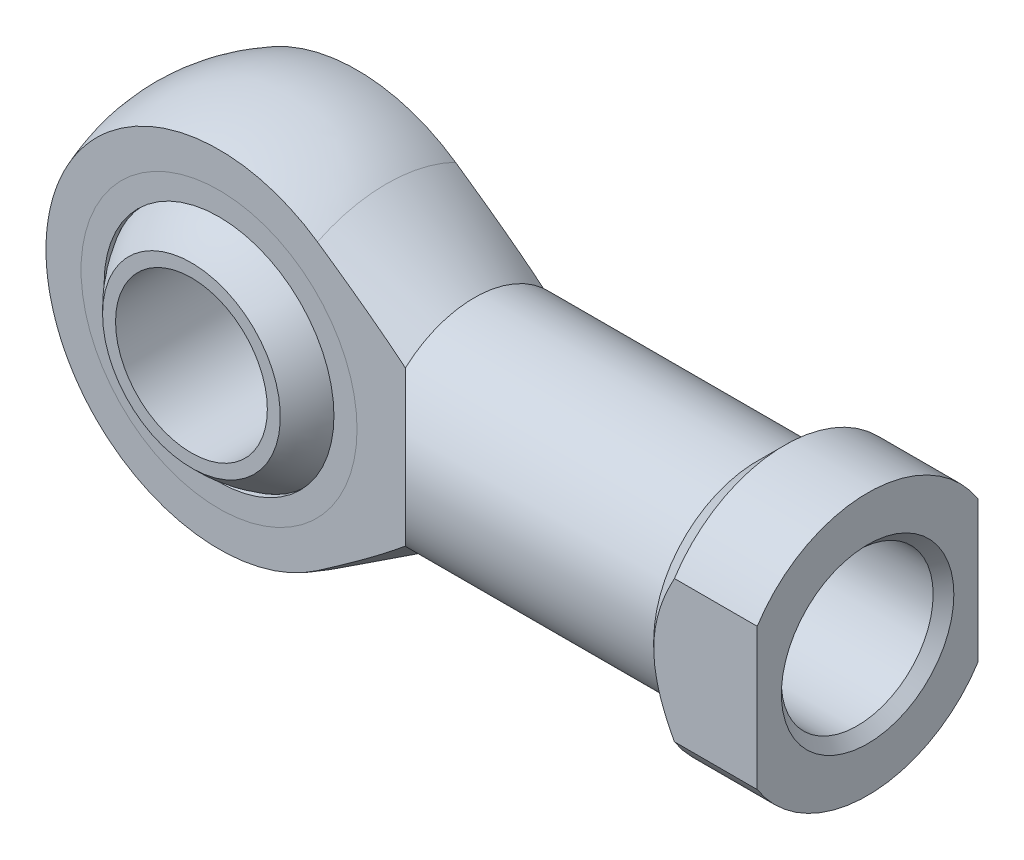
ISO-10303-21;
HEADER;
FILE_DESCRIPTION(('STEP AP214'),'2;1');
FILE_NAME('part.step','',(''),(''),'','','');
FILE_SCHEMA(('AUTOMOTIVE_DESIGN { 1 0 10303 214 1 1 1 1 }'));
ENDSEC;
DATA;
#1=APPLICATION_CONTEXT('core data for automotive mechanical design processes');
#2=APPLICATION_PROTOCOL_DEFINITION('international standard','automotive_design',2000,#1);
#3=PRODUCT_CONTEXT('',#1,'mechanical');
#4=PRODUCT('Part','Part','',(#3));
#5=PRODUCT_RELATED_PRODUCT_CATEGORY('part','',(#4));
#6=PRODUCT_DEFINITION_FORMATION('','',#4);
#7=PRODUCT_DEFINITION_CONTEXT('part definition',#1,'design');
#8=PRODUCT_DEFINITION('design','',#6,#7);
#9=PRODUCT_DEFINITION_SHAPE('','',#8);
#10=(LENGTH_UNIT() NAMED_UNIT(*) SI_UNIT(.MILLI.,.METRE.));
#11=(NAMED_UNIT(*) PLANE_ANGLE_UNIT() SI_UNIT($,.RADIAN.));
#12=(NAMED_UNIT(*) SI_UNIT($,.STERADIAN.) SOLID_ANGLE_UNIT());
#13=UNCERTAINTY_MEASURE_WITH_UNIT(LENGTH_MEASURE(1.E-05),#10,'distance_accuracy_value','');
#14=(GEOMETRIC_REPRESENTATION_CONTEXT(3) GLOBAL_UNCERTAINTY_ASSIGNED_CONTEXT((#13)) GLOBAL_UNIT_ASSIGNED_CONTEXT((#10,
#11,#12)) REPRESENTATION_CONTEXT('',''));
#15=CARTESIAN_POINT('',(0.,0.,0.));
#16=DIRECTION('',(0.,0.,1.));
#17=DIRECTION('',(1.,0.,0.));
#18=AXIS2_PLACEMENT_3D('',#15,#16,#17);
#19=CARTESIAN_POINT('',(0.,0.,0.));
#20=DIRECTION('',(0.,1.,0.));
#21=DIRECTION('',(1.,0.,0.));
#22=AXIS2_PLACEMENT_3D('',#19,#20,#21);
#23=SPHERICAL_SURFACE('',#22,19.025);
#24=CARTESIAN_POINT('',(0.,0.,0.));
#25=DIRECTION('',(0.,0.,-1.));
#26=DIRECTION('',(-1.,0.,0.));
#27=AXIS2_PLACEMENT_3D('',#24,#25,#26);
#28=SPHERICAL_SURFACE('',#27,19.025);
#29=CARTESIAN_POINT('',(0.,0.,14.));
#30=DIRECTION('',(0.,0.,-1.));
#31=DIRECTION('',(-1.,0.,0.));
#32=AXIS2_PLACEMENT_3D('',#29,#30,#31);
#33=CIRCLE('',#32,12.8821824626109);
#34=CARTESIAN_POINT('',(-12.8821824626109,0.,14.));
#35=VERTEX_POINT('',#34);
#36=EDGE_CURVE('P0_E26',#35,#35,#33,.F.);
#37=ORIENTED_EDGE('',*,*,#36,.F.);
#38=EDGE_LOOP('',(#37));
#39=FACE_BOUND('',#38,.T.);
#40=CARTESIAN_POINT('',(0.,0.,-14.));
#41=DIRECTION('',(0.,0.,1.));
#42=DIRECTION('',(1.,0.,0.));
#43=AXIS2_PLACEMENT_3D('',#40,#41,#42);
#44=CIRCLE('',#43,12.8821824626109);
#45=CARTESIAN_POINT('',(12.8821824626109,0.,-14.));
#46=VERTEX_POINT('',#45);
#47=EDGE_CURVE('P0_E10',#46,#46,#44,.F.);
#48=ORIENTED_EDGE('',*,*,#47,.F.);
#49=EDGE_LOOP('',(#48));
#50=FACE_BOUND('',#49,.T.);
#51=ADVANCED_FACE('P0_F14',(#39,#50),#28,.T.);
#52=CARTESIAN_POINT('',(0.,0.,-19.025));
#53=DIRECTION('',(0.,0.,1.));
#54=DIRECTION('',(1.,0.,0.));
#55=AXIS2_PLACEMENT_3D('',#52,#53,#54);
#56=CYLINDRICAL_SURFACE('',#55,11.);
#57=CARTESIAN_POINT('',(0.,0.,14.));
#58=DIRECTION('',(0.,0.,-1.));
#59=DIRECTION('',(-1.,0.,0.));
#60=AXIS2_PLACEMENT_3D('',#57,#58,#59);
#61=CIRCLE('',#60,11.);
#62=CARTESIAN_POINT('',(-11.,0.,14.));
#63=VERTEX_POINT('',#62);
#64=EDGE_CURVE('P0_E17',#63,#63,#61,.F.);
#65=ORIENTED_EDGE('',*,*,#64,.T.);
#66=EDGE_LOOP('',(#65));
#67=FACE_BOUND('',#66,.T.);
#68=CARTESIAN_POINT('',(0.,0.,-14.));
#69=DIRECTION('',(0.,0.,1.));
#70=DIRECTION('',(1.,0.,0.));
#71=AXIS2_PLACEMENT_3D('',#68,#69,#70);
#72=CIRCLE('',#71,11.);
#73=CARTESIAN_POINT('',(11.,0.,-14.));
#74=VERTEX_POINT('',#73);
#75=EDGE_CURVE('P0_E21',#74,#74,#72,.F.);
#76=ORIENTED_EDGE('',*,*,#75,.T.);
#77=EDGE_LOOP('',(#76));
#78=FACE_BOUND('',#77,.T.);
#79=ADVANCED_FACE('P0_F34',(#67,#78),#56,.F.);
#80=CARTESIAN_POINT('',(-19.025,-19.025,-14.));
#81=DIRECTION('',(0.,0.,1.));
#82=DIRECTION('',(1.,0.,0.));
#83=AXIS2_PLACEMENT_3D('',#80,#81,#82);
#84=PLANE('',#83);
#85=ORIENTED_EDGE('',*,*,#47,.T.);
#86=EDGE_LOOP('',(#85));
#87=FACE_BOUND('',#86,.T.);
#88=ORIENTED_EDGE('',*,*,#75,.F.);
#89=EDGE_LOOP('',(#88));
#90=FACE_BOUND('',#89,.T.);
#91=ADVANCED_FACE('P0_F39',(#87,#90),#84,.F.);
#92=CARTESIAN_POINT('',(-19.025,-19.025,14.));
#93=DIRECTION('',(0.,0.,-1.));
#94=DIRECTION('',(-1.,0.,0.));
#95=AXIS2_PLACEMENT_3D('',#92,#93,#94);
#96=PLANE('',#95);
#97=ORIENTED_EDGE('',*,*,#36,.T.);
#98=EDGE_LOOP('',(#97));
#99=FACE_BOUND('',#98,.T.);
#100=ORIENTED_EDGE('',*,*,#64,.F.);
#101=EDGE_LOOP('',(#100));
#102=FACE_BOUND('',#101,.T.);
#103=ADVANCED_FACE('P0_F37',(#99,#102),#96,.F.);
#104=CLOSED_SHELL('',(#51,#79,#91,#103));
#105=MANIFOLD_SOLID_BREP('P0_B1',#104);
#106=CARTESIAN_POINT('',(0.,0.,10.));
#107=DIRECTION('',(0.,0.,1.));
#108=DIRECTION('',(1.,0.,0.));
#109=AXIS2_PLACEMENT_3D('',#106,#107,#108);
#110=PLANE('',#109);
#111=CARTESIAN_POINT('',(0.,0.,10.));
#112=DIRECTION('',(0.,0.,1.));
#113=DIRECTION('',(1.,0.,0.));
#114=AXIS2_PLACEMENT_3D('',#111,#112,#113);
#115=CIRCLE('',#114,20.);
#116=CARTESIAN_POINT('',(20.,0.,10.));
#117=VERTEX_POINT('',#116);
#118=EDGE_CURVE('P1_E10',#117,#117,#115,.T.);
#119=ORIENTED_EDGE('',*,*,#118,.T.);
#120=EDGE_LOOP('',(#119));
#121=FACE_BOUND('',#120,.T.);
#122=CARTESIAN_POINT('',(0.,0.,10.));
#123=DIRECTION('',(0.,0.,1.));
#124=DIRECTION('',(1.,0.,0.));
#125=AXIS2_PLACEMENT_3D('',#122,#123,#124);
#126=CIRCLE('',#125,16.655);
#127=CARTESIAN_POINT('',(16.655,0.,10.));
#128=VERTEX_POINT('',#127);
#129=EDGE_CURVE('P1_E25',#128,#128,#126,.T.);
#130=ORIENTED_EDGE('',*,*,#129,.F.);
#131=EDGE_LOOP('',(#130));
#132=FACE_BOUND('',#131,.T.);
#133=ADVANCED_FACE('P1_F14',(#121,#132),#110,.T.);
#134=CARTESIAN_POINT('',(0.,0.,9.2));
#135=DIRECTION('',(0.,0.,1.));
#136=DIRECTION('',(1.,0.,0.));
#137=AXIS2_PLACEMENT_3D('',#134,#135,#136);
#138=PLANE('',#137);
#139=CARTESIAN_POINT('',(0.,0.,9.2));
#140=DIRECTION('',(0.,0.,1.));
#141=DIRECTION('',(1.,0.,0.));
#142=AXIS2_PLACEMENT_3D('',#139,#140,#141);
#143=CIRCLE('',#142,20.);
#144=CARTESIAN_POINT('',(20.,0.,9.2));
#145=VERTEX_POINT('',#144);
#146=EDGE_CURVE('P1_E18',#145,#145,#143,.T.);
#147=ORIENTED_EDGE('',*,*,#146,.F.);
#148=EDGE_LOOP('',(#147));
#149=FACE_BOUND('',#148,.T.);
#150=CARTESIAN_POINT('',(0.,0.,9.2));
#151=DIRECTION('',(0.,0.,1.));
#152=DIRECTION('',(1.,0.,0.));
#153=AXIS2_PLACEMENT_3D('',#150,#151,#152);
#154=CIRCLE('',#153,16.655);
#155=CARTESIAN_POINT('',(16.655,0.,9.2));
#156=VERTEX_POINT('',#155);
#157=EDGE_CURVE('P1_E27',#156,#156,#154,.T.);
#158=ORIENTED_EDGE('',*,*,#157,.T.);
#159=EDGE_LOOP('',(#158));
#160=FACE_BOUND('',#159,.T.);
#161=ADVANCED_FACE('P1_F37',(#149,#160),#138,.F.);
#162=CARTESIAN_POINT('',(0.,0.,10.));
#163=DIRECTION('',(0.,0.,-1.));
#164=DIRECTION('',(-1.,0.,0.));
#165=AXIS2_PLACEMENT_3D('',#162,#163,#164);
#166=CYLINDRICAL_SURFACE('',#165,20.);
#167=ORIENTED_EDGE('',*,*,#118,.F.);
#168=EDGE_LOOP('',(#167));
#169=FACE_BOUND('',#168,.T.);
#170=ORIENTED_EDGE('',*,*,#146,.T.);
#171=EDGE_LOOP('',(#170));
#172=FACE_BOUND('',#171,.T.);
#173=ADVANCED_FACE('P1_F16',(#169,#172),#166,.T.);
#174=CARTESIAN_POINT('',(0.,0.,10.));
#175=DIRECTION('',(0.,0.,-1.));
#176=DIRECTION('',(-1.,0.,0.));
#177=AXIS2_PLACEMENT_3D('',#174,#175,#176);
#178=CYLINDRICAL_SURFACE('',#177,16.655);
#179=ORIENTED_EDGE('',*,*,#129,.T.);
#180=EDGE_LOOP('',(#179));
#181=FACE_BOUND('',#180,.T.);
#182=ORIENTED_EDGE('',*,*,#157,.F.);
#183=EDGE_LOOP('',(#182));
#184=FACE_BOUND('',#183,.T.);
#185=ADVANCED_FACE('P1_F33',(#181,#184),#178,.F.);
#186=CLOSED_SHELL('',(#133,#161,#173,#185));
#187=MANIFOLD_SOLID_BREP('P1_B1',#186);
#188=CARTESIAN_POINT('',(0.,0.,-9.2));
#189=DIRECTION('',(0.,0.,1.));
#190=DIRECTION('',(1.,0.,0.));
#191=AXIS2_PLACEMENT_3D('',#188,#189,#190);
#192=PLANE('',#191);
#193=CARTESIAN_POINT('',(0.,0.,-9.2));
#194=DIRECTION('',(0.,0.,1.));
#195=DIRECTION('',(1.,0.,0.));
#196=AXIS2_PLACEMENT_3D('',#193,#194,#195);
#197=CIRCLE('',#196,20.);
#198=CARTESIAN_POINT('',(20.,0.,-9.2));
#199=VERTEX_POINT('',#198);
#200=EDGE_CURVE('P2_E10',#199,#199,#197,.T.);
#201=ORIENTED_EDGE('',*,*,#200,.T.);
#202=EDGE_LOOP('',(#201));
#203=FACE_BOUND('',#202,.T.);
#204=CARTESIAN_POINT('',(0.,0.,-9.2));
#205=DIRECTION('',(0.,0.,1.));
#206=DIRECTION('',(1.,0.,0.));
#207=AXIS2_PLACEMENT_3D('',#204,#205,#206);
#208=CIRCLE('',#207,16.655);
#209=CARTESIAN_POINT('',(16.655,0.,-9.2));
#210=VERTEX_POINT('',#209);
#211=EDGE_CURVE('P2_E25',#210,#210,#208,.T.);
#212=ORIENTED_EDGE('',*,*,#211,.F.);
#213=EDGE_LOOP('',(#212));
#214=FACE_BOUND('',#213,.T.);
#215=ADVANCED_FACE('P2_F14',(#203,#214),#192,.T.);
#216=CARTESIAN_POINT('',(0.,0.,-10.));
#217=DIRECTION('',(0.,0.,1.));
#218=DIRECTION('',(1.,0.,0.));
#219=AXIS2_PLACEMENT_3D('',#216,#217,#218);
#220=PLANE('',#219);
#221=CARTESIAN_POINT('',(0.,0.,-10.));
#222=DIRECTION('',(0.,0.,1.));
#223=DIRECTION('',(1.,0.,0.));
#224=AXIS2_PLACEMENT_3D('',#221,#222,#223);
#225=CIRCLE('',#224,20.);
#226=CARTESIAN_POINT('',(20.,0.,-10.));
#227=VERTEX_POINT('',#226);
#228=EDGE_CURVE('P2_E18',#227,#227,#225,.T.);
#229=ORIENTED_EDGE('',*,*,#228,.F.);
#230=EDGE_LOOP('',(#229));
#231=FACE_BOUND('',#230,.T.);
#232=CARTESIAN_POINT('',(0.,0.,-10.));
#233=DIRECTION('',(0.,0.,1.));
#234=DIRECTION('',(1.,0.,0.));
#235=AXIS2_PLACEMENT_3D('',#232,#233,#234);
#236=CIRCLE('',#235,16.655);
#237=CARTESIAN_POINT('',(16.655,0.,-10.));
#238=VERTEX_POINT('',#237);
#239=EDGE_CURVE('P2_E27',#238,#238,#236,.T.);
#240=ORIENTED_EDGE('',*,*,#239,.T.);
#241=EDGE_LOOP('',(#240));
#242=FACE_BOUND('',#241,.T.);
#243=ADVANCED_FACE('P2_F37',(#231,#242),#220,.F.);
#244=CARTESIAN_POINT('',(0.,0.,-9.2));
#245=DIRECTION('',(0.,0.,-1.));
#246=DIRECTION('',(-1.,0.,0.));
#247=AXIS2_PLACEMENT_3D('',#244,#245,#246);
#248=CYLINDRICAL_SURFACE('',#247,20.);
#249=ORIENTED_EDGE('',*,*,#200,.F.);
#250=EDGE_LOOP('',(#249));
#251=FACE_BOUND('',#250,.T.);
#252=ORIENTED_EDGE('',*,*,#228,.T.);
#253=EDGE_LOOP('',(#252));
#254=FACE_BOUND('',#253,.T.);
#255=ADVANCED_FACE('P2_F16',(#251,#254),#248,.T.);
#256=CARTESIAN_POINT('',(0.,0.,-9.2));
#257=DIRECTION('',(0.,0.,-1.));
#258=DIRECTION('',(-1.,0.,0.));
#259=AXIS2_PLACEMENT_3D('',#256,#257,#258);
#260=CYLINDRICAL_SURFACE('',#259,16.655);
#261=ORIENTED_EDGE('',*,*,#211,.T.);
#262=EDGE_LOOP('',(#261));
#263=FACE_BOUND('',#262,.T.);
#264=ORIENTED_EDGE('',*,*,#239,.F.);
#265=EDGE_LOOP('',(#264));
#266=FACE_BOUND('',#265,.T.);
#267=ADVANCED_FACE('P2_F33',(#263,#266),#260,.F.);
#268=CLOSED_SHELL('',(#215,#243,#255,#267));
#269=MANIFOLD_SOLID_BREP('P2_B1',#268);
#270=CARTESIAN_POINT('',(0.,0.,0.));
#271=DIRECTION('',(0.,1.,0.));
#272=DIRECTION('',(1.,0.,0.));
#273=AXIS2_PLACEMENT_3D('',#270,#271,#272);
#274=SPHERICAL_SURFACE('',#273,19.025);
#275=CARTESIAN_POINT('',(0.,0.,0.));
#276=DIRECTION('',(0.,0.,1.));
#277=DIRECTION('',(1.,0.,0.));
#278=AXIS2_PLACEMENT_3D('',#275,#276,#277);
#279=SPHERICAL_SURFACE('',#278,19.025);
#280=CARTESIAN_POINT('',(0.,0.,9.2));
#281=DIRECTION('',(0.,0.,1.));
#282=DIRECTION('',(1.,0.,0.));
#283=AXIS2_PLACEMENT_3D('',#280,#281,#282);
#284=CIRCLE('',#283,16.6526461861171);
#285=CARTESIAN_POINT('',(16.6526461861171,0.,9.2));
#286=VERTEX_POINT('',#285);
#287=EDGE_CURVE('P3_E73',#286,#286,#284,.F.);
#288=ORIENTED_EDGE('',*,*,#287,.F.);
#289=EDGE_LOOP('',(#288));
#290=FACE_BOUND('',#289,.T.);
#291=CARTESIAN_POINT('',(0.,0.,-9.2));
#292=DIRECTION('',(0.,0.,-1.));
#293=DIRECTION('',(-1.,0.,0.));
#294=AXIS2_PLACEMENT_3D('',#291,#292,#293);
#295=CIRCLE('',#294,16.6526461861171);
#296=CARTESIAN_POINT('',(-16.6526461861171,0.,-9.2));
#297=VERTEX_POINT('',#296);
#298=EDGE_CURVE('P3_E20',#297,#297,#295,.F.);
#299=ORIENTED_EDGE('',*,*,#298,.F.);
#300=EDGE_LOOP('',(#299));
#301=FACE_BOUND('',#300,.T.);
#302=ADVANCED_FACE('P3_F16',(#290,#301),#279,.F.);
#303=CARTESIAN_POINT('',(-27.,-27.,-10.));
#304=DIRECTION('',(0.,0.,1.));
#305=DIRECTION('',(1.,0.,0.));
#306=AXIS2_PLACEMENT_3D('',#303,#304,#305);
#307=PLANE('',#306);
#308=CARTESIAN_POINT('',(0.,0.,-10.));
#309=DIRECTION('',(0.,0.,1.));
#310=DIRECTION('',(1.,0.,0.));
#311=AXIS2_PLACEMENT_3D('',#308,#309,#310);
#312=CIRCLE('',#311,25.0798724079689);
#313=CARTESIAN_POINT('',(14.2641509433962,20.6284754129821,-10.));
#314=VERTEX_POINT('',#313);
#315=CARTESIAN_POINT('',(14.2641509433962,-20.6284754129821,-10.));
#316=VERTEX_POINT('',#315);
#317=EDGE_CURVE('P3_E11',#314,#316,#312,.T.);
#318=ORIENTED_EDGE('',*,*,#317,.F.);
#319=CARTESIAN_POINT('',(-53.3250304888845,-64.2059410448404,-10.));
#320=CARTESIAN_POINT('',(-51.5549143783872,-63.0912464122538,-10.));
#321=CARTESIAN_POINT('',(-49.785099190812,-61.9760736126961,-10.));
#322=CARTESIAN_POINT('',(-46.2461946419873,-59.7445676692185,-10.));
#323=CARTESIAN_POINT('',(-44.4771052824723,-58.6282345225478,-10.));
#324=CARTESIAN_POINT('',(-40.9381549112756,-56.3931798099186,-10.));
#325=CARTESIAN_POINT('',(-39.1682946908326,-55.2744569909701,-10.));
#326=CARTESIAN_POINT('',(-35.6296087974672,-53.035384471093,-10.));
#327=CARTESIAN_POINT('',(-33.8607831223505,-51.9150347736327,-10.));
#328=CARTESIAN_POINT('',(-30.312522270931,-49.6648482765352,-10.));
#329=CARTESIAN_POINT('',(-28.5330954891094,-48.5349982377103,-10.));
#330=CARTESIAN_POINT('',(-24.9757846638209,-46.2728470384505,-10.));
#331=CARTESIAN_POINT('',(-23.1979006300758,-45.1405458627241,-10.));
#332=CARTESIAN_POINT('',(-19.6456680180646,-42.8739209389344,-10.));
#333=CARTESIAN_POINT('',(-17.871317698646,-41.7395999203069,-10.));
#334=CARTESIAN_POINT('',(-14.3251169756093,-39.4671429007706,-10.));
#335=CARTESIAN_POINT('',(-12.5532665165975,-38.3290069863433,-10.));
#336=CARTESIAN_POINT('',(-9.01539822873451,-36.0494697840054,-10.));
#337=CARTESIAN_POINT('',(-7.24937564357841,-34.9080758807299,-10.));
#338=CARTESIAN_POINT('',(-3.7214175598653,-32.6186572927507,-10.));
#339=CARTESIAN_POINT('',(-1.95948241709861,-31.4706320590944,-10.));
#340=CARTESIAN_POINT('',(0.681456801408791,-29.740288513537,-10.));
#341=CARTESIAN_POINT('',(1.56265539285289,-29.1613195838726,-10.));
#342=CARTESIAN_POINT('',(3.32328509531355,-28.0007006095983,-10.));
#343=CARTESIAN_POINT('',(4.20271620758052,-27.4190505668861,-10.));
#344=CARTESIAN_POINT('',(5.95919046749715,-26.2527188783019,-10.));
#345=CARTESIAN_POINT('',(6.83623424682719,-25.6680381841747,-10.));
#346=CARTESIAN_POINT('',(8.58771917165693,-24.4948000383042,-10.));
#347=CARTESIAN_POINT('',(9.46216033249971,-23.9062426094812,-10.));
#348=CARTESIAN_POINT('',(11.2075215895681,-22.7245667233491,-10.));
#349=CARTESIAN_POINT('',(12.0784427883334,-22.1314498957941,-10.));
#350=CARTESIAN_POINT('',(13.8162150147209,-20.9392844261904,-10.));
#351=CARTESIAN_POINT('',(14.6830660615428,-20.3402358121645,-10.));
#352=CARTESIAN_POINT('',(16.4125366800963,-19.133886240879,-10.));
#353=CARTESIAN_POINT('',(17.2751500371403,-18.5265763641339,-10.));
#354=CARTESIAN_POINT('',(18.9933504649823,-17.3022052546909,-10.));
#355=CARTESIAN_POINT('',(19.8489380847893,-16.6851447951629,-10.));
#356=CARTESIAN_POINT('',(21.1228318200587,-15.7514046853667,-10.));
#357=CARTESIAN_POINT('',(21.544751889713,-15.4396549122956,-10.));
#358=CARTESIAN_POINT('',(22.3857524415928,-14.8123512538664,-10.));
#359=CARTESIAN_POINT('',(22.8048329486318,-14.4967974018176,-10.));
#360=CARTESIAN_POINT('',(23.6397347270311,-13.8611002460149,-10.));
#361=CARTESIAN_POINT('',(24.055554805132,-13.5409553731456,-10.));
#362=CARTESIAN_POINT('',(24.8830349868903,-12.8953367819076,-10.));
#363=CARTESIAN_POINT('',(25.2946951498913,-12.5698631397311,-10.));
#364=CARTESIAN_POINT('',(26.112034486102,-11.9131738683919,-10.));
#365=CARTESIAN_POINT('',(26.5177241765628,-11.5819713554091,-10.));
#366=CARTESIAN_POINT('',(27.32267655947,-10.9117663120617,-10.));
#367=CARTESIAN_POINT('',(27.7219388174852,-10.5727632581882,-10.));
#368=CARTESIAN_POINT('',(28.5118888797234,-9.88538161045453,-10.));
#369=CARTESIAN_POINT('',(28.9025819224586,-9.53700905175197,-10.));
#370=CARTESIAN_POINT('',(29.6729519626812,-8.82832434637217,-10.));
#371=CARTESIAN_POINT('',(30.052631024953,-8.46801446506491,-10.));
#372=CARTESIAN_POINT('',(30.5199627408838,-8.00601614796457,-10.));
#373=CARTESIAN_POINT('',(30.6146524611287,-7.91142348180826,-10.));
#374=CARTESIAN_POINT('',(30.8029547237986,-7.72116798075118,-10.));
#375=CARTESIAN_POINT('',(30.8965672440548,-7.62550512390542,-10.));
#376=CARTESIAN_POINT('',(31.175663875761,-7.33679306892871,-10.));
#377=CARTESIAN_POINT('',(31.3593909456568,-7.14203626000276,-10.));
#378=CARTESIAN_POINT('',(31.7214597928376,-6.74707973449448,-10.));
#379=CARTESIAN_POINT('',(31.8997939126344,-6.54687298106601,-10.));
#380=CARTESIAN_POINT('',(32.2496056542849,-6.14054621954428,-10.));
#381=CARTESIAN_POINT('',(32.4210835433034,-5.93442644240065,-10.));
#382=CARTESIAN_POINT('',(32.7535995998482,-5.51799412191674,-10.));
#383=CARTESIAN_POINT('',(32.9147393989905,-5.30776309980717,-10.));
#384=CARTESIAN_POINT('',(33.2269069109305,-4.87982280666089,-10.));
#385=CARTESIAN_POINT('',(33.3779329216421,-4.66211228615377,-10.));
#386=CARTESIAN_POINT('',(33.6670204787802,-4.21886857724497,-10.));
#387=CARTESIAN_POINT('',(33.8051096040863,-3.99335350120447,-10.));
#388=CARTESIAN_POINT('',(34.0654564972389,-3.53342189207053,-10.));
#389=CARTESIAN_POINT('',(34.187723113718,-3.29901042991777,-10.));
#390=CARTESIAN_POINT('',(34.3898474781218,-2.86918234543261,-10.));
#391=CARTESIAN_POINT('',(34.4732826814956,-2.67545503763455,-10.));
#392=CARTESIAN_POINT('',(34.6253354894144,-2.2822221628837,-10.));
#393=CARTESIAN_POINT('',(34.6939539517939,-2.08271693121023,-10.));
#394=CARTESIAN_POINT('',(34.8139226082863,-1.67881761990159,-10.));
#395=CARTESIAN_POINT('',(34.8652960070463,-1.47443050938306,-10.));
#396=CARTESIAN_POINT('',(34.9487234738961,-1.06176335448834,-10.));
#397=CARTESIAN_POINT('',(34.9807832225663,-0.853484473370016,-10.));
#398=CARTESIAN_POINT('',(35.0242525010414,-0.432654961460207,-10.));
#399=CARTESIAN_POINT('',(35.0354534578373,-0.220082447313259,-10.));
#400=CARTESIAN_POINT('',(35.0359660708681,0.205080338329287,-10.));
#401=CARTESIAN_POINT('',(35.0252785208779,0.41767060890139,-10.));
#402=CARTESIAN_POINT('',(34.9825652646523,0.840947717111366,-10.));
#403=CARTESIAN_POINT('',(34.950511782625,1.0516317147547,-10.));
#404=CARTESIAN_POINT('',(34.8666426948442,1.46900940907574,-10.));
#405=CARTESIAN_POINT('',(34.8148232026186,1.67570231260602,-10.));
#406=CARTESIAN_POINT('',(34.6808276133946,2.1270100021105,-10.));
#407=CARTESIAN_POINT('',(34.5945492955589,2.37040059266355,-10.));
#408=CARTESIAN_POINT('',(34.4005824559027,2.84844262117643,-10.));
#409=CARTESIAN_POINT('',(34.2928865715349,3.08309102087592,-10.));
#410=CARTESIAN_POINT('',(34.0598609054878,3.54410167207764,-10.));
#411=CARTESIAN_POINT('',(33.9344881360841,3.77044197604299,-10.));
#412=CARTESIAN_POINT('',(33.6697654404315,4.21466114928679,-10.));
#413=CARTESIAN_POINT('',(33.5304177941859,4.43254139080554,-10.));
#414=CARTESIAN_POINT('',(33.1687036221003,4.96667673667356,-10.));
#415=CARTESIAN_POINT('',(32.9393971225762,5.27821841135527,-10.));
#416=CARTESIAN_POINT('',(32.4624460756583,5.887032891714,-10.));
#417=CARTESIAN_POINT('',(32.2147900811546,6.18429659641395,-10.));
#418=CARTESIAN_POINT('',(31.7053196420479,6.76750445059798,-10.));
#419=CARTESIAN_POINT('',(31.4434754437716,7.05342244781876,-10.));
#420=CARTESIAN_POINT('',(30.9094519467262,7.61525525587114,-10.));
#421=CARTESIAN_POINT('',(30.6372749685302,7.89117228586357,-10.));
#422=CARTESIAN_POINT('',(30.0828045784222,8.43674842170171,-10.));
#423=CARTESIAN_POINT('',(29.8004515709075,8.70634672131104,-10.));
#424=CARTESIAN_POINT('',(29.229231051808,9.23855380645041,-10.));
#425=CARTESIAN_POINT('',(28.9403632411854,9.50116226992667,-10.));
#426=CARTESIAN_POINT('',(28.3577921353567,10.0201166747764,-10.));
#427=CARTESIAN_POINT('',(28.0640961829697,10.276470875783,-10.));
#428=CARTESIAN_POINT('',(27.6203462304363,10.6572421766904,-10.));
#429=CARTESIAN_POINT('',(27.4718974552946,10.7835374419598,-10.));
#430=CARTESIAN_POINT('',(27.1740216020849,11.0349688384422,-10.));
#431=CARTESIAN_POINT('',(27.0245945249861,11.1601049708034,-10.));
#432=CARTESIAN_POINT('',(26.5240436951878,11.5762543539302,-10.));
#433=CARTESIAN_POINT('',(26.170927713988,11.8648740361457,-10.));
#434=CARTESIAN_POINT('',(25.4607197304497,12.4371858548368,-10.));
#435=CARTESIAN_POINT('',(25.1036276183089,12.7208778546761,-10.));
#436=CARTESIAN_POINT('',(24.3861195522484,13.2840935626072,-10.));
#437=CARTESIAN_POINT('',(24.0257032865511,13.5636168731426,-10.));
#438=CARTESIAN_POINT('',(23.3021054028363,14.1190637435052,-10.));
#439=CARTESIAN_POINT('',(22.9389237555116,14.3949872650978,-10.));
#440=CARTESIAN_POINT('',(21.8456277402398,15.2183049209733,-10.));
#441=CARTESIAN_POINT('',(21.1120124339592,15.7610510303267,-10.));
#442=CARTESIAN_POINT('',(19.6379088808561,16.837127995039,-10.));
#443=CARTESIAN_POINT('',(18.897420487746,17.3704586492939,-10.));
#444=CARTESIAN_POINT('',(17.7821570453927,18.1653389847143,-10.));
#445=CARTESIAN_POINT('',(17.4093490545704,18.4296547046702,-10.));
#446=CARTESIAN_POINT('',(16.662569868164,18.9566278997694,-10.));
#447=CARTESIAN_POINT('',(16.288598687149,19.2192853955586,-10.));
#448=CARTESIAN_POINT('',(15.1651282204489,20.0050558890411,-10.));
#449=CARTESIAN_POINT('',(14.4140830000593,20.5259590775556,-10.));
#450=CARTESIAN_POINT('',(12.9088877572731,21.56288229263,-10.));
#451=CARTESIAN_POINT('',(12.1547384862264,22.0789034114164,-10.));
#452=CARTESIAN_POINT('',(10.6437767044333,23.1070326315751,-10.));
#453=CARTESIAN_POINT('',(9.88696418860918,23.6191407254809,-10.));
#454=CARTESIAN_POINT('',(8.37494284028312,24.6375468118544,-10.));
#455=CARTESIAN_POINT('',(7.61974494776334,25.1438610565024,-10.));
#456=CARTESIAN_POINT('',(6.10753512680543,26.1537741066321,-10.));
#457=CARTESIAN_POINT('',(5.35052319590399,26.6573729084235,-10.));
#458=CARTESIAN_POINT('',(3.07712425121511,28.1647813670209,-10.));
#459=CARTESIAN_POINT('',(1.55845479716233,29.1651488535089,-10.));
#460=CARTESIAN_POINT('',(-1.48198904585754,31.1582318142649,-10.));
#461=CARTESIAN_POINT('',(-3.00375954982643,32.150953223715,-10.));
#462=CARTESIAN_POINT('',(-6.05063080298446,34.1312087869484,-10.));
#463=CARTESIAN_POINT('',(-7.57573149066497,35.1187430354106,-10.));
#464=CARTESIAN_POINT('',(-10.2973632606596,36.8759557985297,-10.));
#465=CARTESIAN_POINT('',(-11.493390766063,37.646414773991,-10.));
#466=CARTESIAN_POINT('',(-13.8867781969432,39.1852607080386,-10.));
#467=CARTESIAN_POINT('',(-15.0841381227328,39.9536476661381,-10.));
#468=CARTESIAN_POINT('',(-18.6778888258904,42.2562076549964,-10.));
#469=CARTESIAN_POINT('',(-21.0759473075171,43.7877777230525,-10.));
#470=CARTESIAN_POINT('',(-25.8753106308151,46.8458812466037,-10.));
#471=CARTESIAN_POINT('',(-28.2766155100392,48.372414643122,-10.));
#472=CARTESIAN_POINT('',(-33.0816485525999,51.4216636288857,-10.));
#473=CARTESIAN_POINT('',(-35.4853767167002,52.9443792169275,-10.));
#474=CARTESIAN_POINT('',(-40.2956675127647,55.9874775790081,-10.));
#475=CARTESIAN_POINT('',(-42.7022308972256,57.5078591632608,-10.));
#476=CARTESIAN_POINT('',(-47.5168289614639,60.5462914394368,-10.));
#477=CARTESIAN_POINT('',(-49.9248636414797,62.0643421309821,-10.));
#478=CARTESIAN_POINT('',(-57.1506923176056,66.6156992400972,-10.));
#479=CARTESIAN_POINT('',(-61.9702365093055,69.6462268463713,-10.));
#480=CARTESIAN_POINT('',(-71.6326087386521,75.7150003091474,-10.));
#481=CARTESIAN_POINT('',(-76.4754498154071,78.7532253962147,-10.));
#482=CARTESIAN_POINT('',(-86.1633580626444,84.8261423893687,-10.));
#483=CARTESIAN_POINT('',(-91.008425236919,87.860834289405,-10.));
#484=CARTESIAN_POINT('',(-100.698030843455,93.9263041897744,-10.));
#485=CARTESIAN_POINT('',(-105.542568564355,96.9570833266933,-10.));
#486=CARTESIAN_POINT('',(-115.232870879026,103.016658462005,-10.));
#487=CARTESIAN_POINT('',(-120.078635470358,106.045454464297,-10.));
#488=CARTESIAN_POINT('',(-124.924831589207,109.073559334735,-10.));
#489=B_SPLINE_CURVE_WITH_KNOTS('',3,(#319,#320,#321,#322,#323,#324,#325,#326,#327,#328,#329,
#330,#331,#332,#333,#334,#335,#336,#337,#338,#339,#340,#341,#342,#343,#344,#345,#346,#347,#348,
#349,#350,#351,#352,#353,#354,#355,#356,#357,#358,#359,#360,#361,#362,#363,#364,#365,#366,#367,
#368,#369,#370,#371,#372,#373,#374,#375,#376,#377,#378,#379,#380,#381,#382,#383,#384,#385,#386,
#387,#388,#389,#390,#391,#392,#393,#394,#395,#396,#397,#398,#399,#400,#401,#402,#403,#404,#405,
#406,#407,#408,#409,#410,#411,#412,#413,#414,#415,#416,#417,#418,#419,#420,#421,#422,#423,#424,
#425,#426,#427,#428,#429,#430,#431,#432,#433,#434,#435,#436,#437,#438,#439,#440,#441,#442,#443,
#444,#445,#446,#447,#448,#449,#450,#451,#452,#453,#454,#455,#456,#457,#458,#459,#460,#461,#462,
#463,#464,#465,#466,#467,#468,#469,#470,#471,#472,#473,#474,#475,#476,#477,#478,#479,#480,#481,
#482,#483,#484,#485,#486,#487,#488),.UNSPECIFIED.,.F.,.F.,(4,2,2,2,2,2,2,2,2,2,2,2,2,2,2,2,2,2,
2,2,2,2,2,2,2,2,2,2,2,2,2,2,2,2,2,2,2,2,2,2,2,2,2,2,2,2,2,2,2,2,2,2,2,2,2,2,2,2,2,2,2,2,2,2,2,2,
2,2,2,2,2,2,2,2,2,2,2,2,2,2,2,2,2,2,4),(0.,6.27556360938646,12.5511421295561,18.8325037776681,
25.1138520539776,31.4373215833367,37.7608306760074,44.0786611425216,50.3963493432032,
56.7046313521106,63.0134432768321,66.1765777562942,69.3397099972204,72.5019027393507,
75.6640768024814,78.8251687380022,81.9862457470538,85.151060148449,88.3156248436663,
89.8894060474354,91.4631734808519,93.0374922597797,94.6117885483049,96.1828625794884,
97.7540423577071,99.3242332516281,100.894127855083,101.295649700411,101.697179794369,
102.500307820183,103.304527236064,104.108715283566,104.903119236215,105.697656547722,
106.490459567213,107.282817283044,107.915099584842,108.547345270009,109.178736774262,
109.809942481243,110.447426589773,111.084887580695,111.723178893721,112.361595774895,
113.135022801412,113.908716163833,114.684324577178,115.459806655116,116.61930353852,
117.779529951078,118.942291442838,120.104793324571,121.275828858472,122.446918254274,
123.616366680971,124.201073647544,124.785780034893,126.153904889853,127.522067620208,
128.890360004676,130.258666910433,132.996232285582,135.733856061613,137.104850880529,
138.475828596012,141.217824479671,143.959191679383,146.700564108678,149.428212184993,
152.155863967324,157.611459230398,163.062275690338,168.512992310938,172.7811043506,
177.04921739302,185.585454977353,194.12179216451,202.658132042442,211.197917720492,
219.737704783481,236.817188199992,253.96814244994,271.119126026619,288.262535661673,
305.405911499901),.UNSPECIFIED.);
#490=CARTESIAN_POINT('',(27.,11.180339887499,-10.));
#491=VERTEX_POINT('',#490);
#492=EDGE_CURVE('P3_E102',#491,#314,#489,.T.);
#493=ORIENTED_EDGE('',*,*,#492,.F.);
#494=DIRECTION('',(0.,1.,0.));
#495=VECTOR('',#494,1.);
#496=CARTESIAN_POINT('',(27.,-27.,-10.));
#497=LINE('',#496,#495);
#498=CARTESIAN_POINT('',(27.,-11.180339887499,-10.));
#499=VERTEX_POINT('',#498);
#500=EDGE_CURVE('P3_E64',#499,#491,#497,.T.);
#501=ORIENTED_EDGE('',*,*,#500,.F.);
#502=EDGE_CURVE('P3_E33',#316,#499,#489,.T.);
#503=ORIENTED_EDGE('',*,*,#502,.F.);
#504=EDGE_LOOP('',(#318,#493,#501,#503));
#505=FACE_BOUND('',#504,.T.);
#506=CARTESIAN_POINT('',(0.,0.,-10.));
#507=DIRECTION('',(0.,0.,1.));
#508=DIRECTION('',(1.,0.,0.));
#509=AXIS2_PLACEMENT_3D('',#506,#507,#508);
#510=CIRCLE('',#509,20.);
#511=CARTESIAN_POINT('',(20.,0.,-10.));
#512=VERTEX_POINT('',#511);
#513=EDGE_CURVE('P3_E95',#512,#512,#510,.T.);
#514=ORIENTED_EDGE('',*,*,#513,.T.);
#515=EDGE_LOOP('',(#514));
#516=FACE_BOUND('',#515,.T.);
#517=ADVANCED_FACE('P3_F125',(#505,#516),#307,.F.);
#518=CARTESIAN_POINT('',(27.,0.,0.));
#519=DIRECTION('',(-1.,0.,0.));
#520=DIRECTION('',(0.,0.,1.));
#521=AXIS2_PLACEMENT_3D('',#518,#519,#520);
#522=CONICAL_SURFACE('',#521,15.,0.556599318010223);
#523=CARTESIAN_POINT('',(14.2641509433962,0.,0.));
#524=DIRECTION('',(-1.,0.,0.));
#525=DIRECTION('',(0.,0.,1.));
#526=AXIS2_PLACEMENT_3D('',#523,#524,#525);
#527=CIRCLE('',#526,22.9245283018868);
#528=CARTESIAN_POINT('',(14.2641509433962,-20.6284754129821,10.));
#529=VERTEX_POINT('',#528);
#530=EDGE_CURVE('P3_E79',#316,#529,#527,.T.);
#531=ORIENTED_EDGE('',*,*,#530,.F.);
#532=ORIENTED_EDGE('',*,*,#502,.T.);
#533=CARTESIAN_POINT('',(27.,0.,0.));
#534=DIRECTION('',(-1.,0.,0.));
#535=DIRECTION('',(0.,0.,1.));
#536=AXIS2_PLACEMENT_3D('',#533,#534,#535);
#537=CIRCLE('',#536,15.);
#538=CARTESIAN_POINT('',(27.,-11.180339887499,10.));
#539=VERTEX_POINT('',#538);
#540=EDGE_CURVE('P3_E70',#499,#539,#537,.T.);
#541=ORIENTED_EDGE('',*,*,#540,.T.);
#542=CARTESIAN_POINT('',(-52.9252266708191,-63.9541633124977,10.));
#543=CARTESIAN_POINT('',(-51.1619730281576,-62.8436863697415,10.));
#544=CARTESIAN_POINT('',(-49.3990215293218,-61.7327293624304,10.));
#545=CARTESIAN_POINT('',(-45.8738472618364,-59.5096503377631,10.));
#546=CARTESIAN_POINT('',(-44.1116244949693,-58.3975283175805,10.));
#547=CARTESIAN_POINT('',(-40.586380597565,-56.1708712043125,10.));
#548=CARTESIAN_POINT('',(-38.8233602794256,-55.0563348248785,10.));
#549=CARTESIAN_POINT('',(-35.2983585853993,-52.825628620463,10.));
#550=CARTESIAN_POINT('',(-33.5363772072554,-51.7094587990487,10.));
#551=CARTESIAN_POINT('',(-30.0017474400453,-49.467583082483,10.));
#552=CARTESIAN_POINT('',(-28.2291075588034,-48.3418637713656,10.));
#553=CARTESIAN_POINT('',(-24.6853771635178,-46.0879635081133,10.));
#554=CARTESIAN_POINT('',(-22.9142866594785,-44.9597825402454,10.));
#555=CARTESIAN_POINT('',(-19.3756796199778,-42.701404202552,10.));
#556=CARTESIAN_POINT('',(-17.6081612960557,-41.5712096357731,10.));
#557=CARTESIAN_POINT('',(-14.0756365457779,-39.3069895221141,10.));
#558=CARTESIAN_POINT('',(-12.310630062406,-38.1729640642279,10.));
#559=CARTESIAN_POINT('',(-8.78651373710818,-35.9016582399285,10.));
#560=CARTESIAN_POINT('',(-7.02739900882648,-34.7643854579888,10.));
#561=CARTESIAN_POINT('',(-3.51327350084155,-32.4831785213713,10.));
#562=CARTESIAN_POINT('',(-1.75826308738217,-31.3392438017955,10.));
#563=CARTESIAN_POINT('',(0.872313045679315,-29.6149755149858,10.));
#564=CARTESIAN_POINT('',(1.75008391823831,-29.0380061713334,10.));
#565=CARTESIAN_POINT('',(3.50384909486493,-27.8813738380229,10.));
#566=CARTESIAN_POINT('',(4.37984340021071,-27.3017108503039,10.));
#567=CARTESIAN_POINT('',(6.1294274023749,-26.1393417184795,10.));
#568=CARTESIAN_POINT('',(7.0030177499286,-25.556636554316,10.));
#569=CARTESIAN_POINT('',(8.74758158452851,-24.3873307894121,10.));
#570=CARTESIAN_POINT('',(9.61855508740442,-23.800730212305,10.));
#571=CARTESIAN_POINT('',(11.3570269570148,-22.6229012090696,10.));
#572=CARTESIAN_POINT('',(12.2245261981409,-22.0316740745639,10.));
#573=CARTESIAN_POINT('',(13.9554298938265,-20.843256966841,10.));
#574=CARTESIAN_POINT('',(14.8188343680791,-20.2460670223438,10.));
#575=CARTESIAN_POINT('',(16.5413993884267,-19.043378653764,10.));
#576=CARTESIAN_POINT('',(17.400553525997,-18.437871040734,10.));
#577=CARTESIAN_POINT('',(19.1117865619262,-17.2170498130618,10.));
#578=CARTESIAN_POINT('',(19.9638660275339,-16.6017369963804,10.));
#579=CARTESIAN_POINT('',(21.2324022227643,-15.6705932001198,10.));
#580=CARTESIAN_POINT('',(21.6524998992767,-15.3597218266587,10.));
#581=CARTESIAN_POINT('',(22.4898344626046,-14.7341527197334,10.));
#582=CARTESIAN_POINT('',(22.9070713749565,-14.4194550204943,10.));
#583=CARTESIAN_POINT('',(23.7382624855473,-13.7854407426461,10.));
#584=CARTESIAN_POINT('',(24.1522154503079,-13.466122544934,10.));
#585=CARTESIAN_POINT('',(24.9759271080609,-12.8221244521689,10.));
#586=CARTESIAN_POINT('',(25.3856858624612,-12.4974446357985,10.));
#587=CARTESIAN_POINT('',(26.1991609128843,-11.8423173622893,10.));
#588=CARTESIAN_POINT('',(26.6028880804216,-11.5118834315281,10.));
#589=CARTESIAN_POINT('',(27.4038570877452,-10.8431651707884,10.));
#590=CARTESIAN_POINT('',(27.8010984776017,-10.504880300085,10.));
#591=CARTESIAN_POINT('',(28.5869205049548,-9.81887737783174,10.));
#592=CARTESIAN_POINT('',(28.9755065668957,-9.47116555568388,10.));
#593=CARTESIAN_POINT('',(29.7415472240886,-8.76372436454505,10.));
#594=CARTESIAN_POINT('',(30.11900395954,-8.40399733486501,10.));
#595=CARTESIAN_POINT('',(30.583499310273,-7.94260913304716,10.));
#596=CARTESIAN_POINT('',(30.6776536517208,-7.84808871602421,10.));
#597=CARTESIAN_POINT('',(30.8648713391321,-7.65796939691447,10.));
#598=CARTESIAN_POINT('',(30.9579346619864,-7.56237047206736,10.));
#599=CARTESIAN_POINT('',(31.2353610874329,-7.27383653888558,10.));
#600=CARTESIAN_POINT('',(31.4179441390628,-7.07918071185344,10.));
#601=CARTESIAN_POINT('',(31.7776511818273,-6.68438236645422,10.));
#602=CARTESIAN_POINT('',(31.9547672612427,-6.48423262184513,10.));
#603=CARTESIAN_POINT('',(32.302045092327,-6.07797821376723,10.));
#604=CARTESIAN_POINT('',(32.4722071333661,-5.87187379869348,10.));
#605=CARTESIAN_POINT('',(32.8019127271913,-5.45552071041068,10.));
#606=CARTESIAN_POINT('',(32.9615630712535,-5.24535699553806,10.));
#607=CARTESIAN_POINT('',(33.2706117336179,-4.81751811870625,10.));
#608=CARTESIAN_POINT('',(33.4200082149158,-4.59984162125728,10.));
#609=CARTESIAN_POINT('',(33.7056606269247,-4.15665722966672,10.));
#610=CARTESIAN_POINT('',(33.8419449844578,-3.93116778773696,10.));
#611=CARTESIAN_POINT('',(34.0984715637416,-3.47131149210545,10.));
#612=CARTESIAN_POINT('',(34.2187234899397,-3.23695011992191,10.));
#613=CARTESIAN_POINT('',(34.4173136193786,-2.80664809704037,10.));
#614=CARTESIAN_POINT('',(34.499228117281,-2.6123650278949,10.));
#615=CARTESIAN_POINT('',(34.647997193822,-2.21806829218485,10.));
#616=CARTESIAN_POINT('',(34.7148527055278,-2.01805498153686,10.));
#617=CARTESIAN_POINT('',(34.8310575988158,-1.61326541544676,10.));
#618=CARTESIAN_POINT('',(34.8804323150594,-1.4084965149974,10.));
#619=CARTESIAN_POINT('',(34.9596895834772,-0.995184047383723,10.));
#620=CARTESIAN_POINT('',(34.9895732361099,-0.786640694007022,10.));
#621=CARTESIAN_POINT('',(35.0285508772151,-0.365657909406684,10.));
#622=CARTESIAN_POINT('',(35.0374514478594,-0.153200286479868,10.));
#623=CARTESIAN_POINT('',(35.0334148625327,0.271497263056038,10.));
#624=CARTESIAN_POINT('',(35.0204782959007,0.483737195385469,10.));
#625=CARTESIAN_POINT('',(34.9734292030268,0.906133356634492,10.));
#626=CARTESIAN_POINT('',(34.9392863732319,1.11628616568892,10.));
#627=CARTESIAN_POINT('',(34.8514819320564,1.53245294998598,10.));
#628=CARTESIAN_POINT('',(34.7978164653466,1.73846609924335,10.));
#629=CARTESIAN_POINT('',(34.6588741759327,2.19200050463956,10.));
#630=CARTESIAN_POINT('',(34.56916391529,2.43815719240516,10.));
#631=CARTESIAN_POINT('',(34.3681359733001,2.92143115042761,10.));
#632=CARTESIAN_POINT('',(34.2568103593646,3.15854506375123,10.));
#633=CARTESIAN_POINT('',(34.0164371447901,3.62427111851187,10.));
#634=CARTESIAN_POINT('',(33.8873460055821,3.85286056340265,10.));
#635=CARTESIAN_POINT('',(33.6151769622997,4.30141348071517,10.));
#636=CARTESIAN_POINT('',(33.4721015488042,4.521378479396,10.));
#637=CARTESIAN_POINT('',(33.0972930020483,5.06613685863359,10.));
#638=CARTESIAN_POINT('',(32.8581992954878,5.3858515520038,10.));
#639=CARTESIAN_POINT('',(32.3612289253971,6.01043705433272,10.));
#640=CARTESIAN_POINT('',(32.1033402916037,6.31529819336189,10.));
#641=CARTESIAN_POINT('',(31.5731278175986,6.91332947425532,10.));
#642=CARTESIAN_POINT('',(31.3007732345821,7.20647219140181,10.));
#643=CARTESIAN_POINT('',(30.7455949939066,7.78247667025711,10.));
#644=CARTESIAN_POINT('',(30.4627737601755,8.06534078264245,10.));
#645=CARTESIAN_POINT('',(29.8868783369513,8.62465299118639,10.));
#646=CARTESIAN_POINT('',(29.5937445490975,8.90103948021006,10.));
#647=CARTESIAN_POINT('',(29.000918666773,9.44669129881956,10.));
#648=CARTESIAN_POINT('',(28.70122626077,9.71595628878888,10.));
#649=CARTESIAN_POINT('',(28.0970059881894,10.2481156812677,10.));
#650=CARTESIAN_POINT('',(27.7924856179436,10.5110186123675,10.));
#651=CARTESIAN_POINT('',(27.3324919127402,10.901564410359,10.));
#652=CARTESIAN_POINT('',(27.1786274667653,11.0311096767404,10.));
#653=CARTESIAN_POINT('',(26.8699188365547,11.2890273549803,10.));
#654=CARTESIAN_POINT('',(26.7150746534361,11.4173997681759,10.));
#655=CARTESIAN_POINT('',(26.1931852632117,11.8470105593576,10.));
#656=CARTESIAN_POINT('',(25.8241029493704,12.1457770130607,10.));
#657=CARTESIAN_POINT('',(25.0819025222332,12.738260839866,10.));
#658=CARTESIAN_POINT('',(24.7087843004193,13.0319780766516,10.));
#659=CARTESIAN_POINT('',(23.9591836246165,13.615155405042,10.));
#660=CARTESIAN_POINT('',(23.5827008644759,13.9046151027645,10.));
#661=CARTESIAN_POINT('',(22.8269433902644,14.4798692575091,10.));
#662=CARTESIAN_POINT('',(22.4476686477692,14.7656636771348,10.));
#663=CARTESIAN_POINT('',(21.3060660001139,15.6185228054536,10.));
#664=CARTESIAN_POINT('',(20.540211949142,16.1808683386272,10.));
#665=CARTESIAN_POINT('',(19.0016076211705,17.2960446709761,10.));
#666=CARTESIAN_POINT('',(18.228857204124,17.8488752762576,10.));
#667=CARTESIAN_POINT('',(17.0651874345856,18.6729728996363,10.));
#668=CARTESIAN_POINT('',(16.676236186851,18.9470249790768,10.));
#669=CARTESIAN_POINT('',(15.8971713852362,19.4934622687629,10.));
#670=CARTESIAN_POINT('',(15.5070578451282,19.7658474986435,10.));
#671=CARTESIAN_POINT('',(14.3351634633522,20.580793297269,10.));
#672=CARTESIAN_POINT('',(13.5518400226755,21.1211360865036,10.));
#673=CARTESIAN_POINT('',(11.9821038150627,22.1969345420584,10.));
#674=CARTESIAN_POINT('',(11.195691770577,22.7323912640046,10.));
#675=CARTESIAN_POINT('',(9.62022107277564,23.7993977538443,10.));
#676=CARTESIAN_POINT('',(8.83116241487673,24.3309475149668,10.));
#677=CARTESIAN_POINT('',(7.25496416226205,25.3880598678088,10.));
#678=CARTESIAN_POINT('',(6.46783579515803,25.9136392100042,10.));
#679=CARTESIAN_POINT('',(4.89178263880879,26.9620982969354,10.));
#680=CARTESIAN_POINT('',(4.10285784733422,27.4849780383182,10.));
#681=CARTESIAN_POINT('',(1.73374451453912,29.0502556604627,10.));
#682=CARTESIAN_POINT('',(0.151298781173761,30.0892372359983,10.));
#683=CARTESIAN_POINT('',(-3.01663237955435,32.1596201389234,10.));
#684=CARTESIAN_POINT('',(-4.60211411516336,33.1910271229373,10.));
#685=CARTESIAN_POINT('',(-7.77635964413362,35.2487144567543,10.));
#686=CARTESIAN_POINT('',(-9.36512337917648,36.2749948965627,10.));
#687=CARTESIAN_POINT('',(-13.3462549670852,38.8396382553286,10.));
#688=CARTESIAN_POINT('',(-15.7402301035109,40.3755053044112,10.));
#689=CARTESIAN_POINT('',(-20.5322398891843,43.4408957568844,10.));
#690=CARTESIAN_POINT('',(-22.9302745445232,44.9704191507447,10.));
#691=CARTESIAN_POINT('',(-27.7293548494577,48.0247889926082,10.));
#692=CARTESIAN_POINT('',(-30.1304005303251,49.5496353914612,10.));
#693=CARTESIAN_POINT('',(-34.9347491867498,52.595768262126,10.));
#694=CARTESIAN_POINT('',(-37.3380521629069,54.1170547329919,10.));
#695=CARTESIAN_POINT('',(-42.1473289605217,57.1574447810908,10.));
#696=CARTESIAN_POINT('',(-44.5533034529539,58.6765472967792,10.));
#697=CARTESIAN_POINT('',(-49.366638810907,61.7125546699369,10.));
#698=CARTESIAN_POINT('',(-51.7739996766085,63.2294595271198,10.));
#699=CARTESIAN_POINT('',(-58.9977170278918,67.7775281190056,10.));
#700=CARTESIAN_POINT('',(-63.8157305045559,70.8060599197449,10.));
#701=CARTESIAN_POINT('',(-73.4786966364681,76.8734529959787,10.));
#702=CARTESIAN_POINT('',(-78.3236640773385,79.9122907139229,10.));
#703=CARTESIAN_POINT('',(-88.0157344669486,85.9865744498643,10.));
#704=CARTESIAN_POINT('',(-92.862837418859,89.022020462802,10.));
#705=CARTESIAN_POINT('',(-102.556572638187,95.0891649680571,10.));
#706=CARTESIAN_POINT('',(-107.403204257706,98.1208644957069,10.));
#707=CARTESIAN_POINT('',(-117.097654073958,104.182347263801,10.));
#708=CARTESIAN_POINT('',(-121.945472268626,107.212130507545,10.));
#709=CARTESIAN_POINT('',(-126.793709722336,110.241242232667,10.));
#710=B_SPLINE_CURVE_WITH_KNOTS('',3,(#542,#543,#544,#545,#546,#547,#548,#549,#550,#551,#552,
#553,#554,#555,#556,#557,#558,#559,#560,#561,#562,#563,#564,#565,#566,#567,#568,#569,#570,#571,
#572,#573,#574,#575,#576,#577,#578,#579,#580,#581,#582,#583,#584,#585,#586,#587,#588,#589,#590,
#591,#592,#593,#594,#595,#596,#597,#598,#599,#600,#601,#602,#603,#604,#605,#606,#607,#608,#609,
#610,#611,#612,#613,#614,#615,#616,#617,#618,#619,#620,#621,#622,#623,#624,#625,#626,#627,#628,
#629,#630,#631,#632,#633,#634,#635,#636,#637,#638,#639,#640,#641,#642,#643,#644,#645,#646,#647,
#648,#649,#650,#651,#652,#653,#654,#655,#656,#657,#658,#659,#660,#661,#662,#663,#664,#665,#666,
#667,#668,#669,#670,#671,#672,#673,#674,#675,#676,#677,#678,#679,#680,#681,#682,#683,#684,#685,
#686,#687,#688,#689,#690,#691,#692,#693,#694,#695,#696,#697,#698,#699,#700,#701,#702,#703,#704,
#705,#706,#707,#708,#709),.UNSPECIFIED.,.F.,.F.,(4,2,2,2,2,2,2,2,2,2,2,2,2,2,2,2,2,2,2,2,2,2,2,
2,2,2,2,2,2,2,2,2,2,2,2,2,2,2,2,2,2,2,2,2,2,2,2,2,2,2,2,2,2,2,2,2,2,2,2,2,2,2,2,2,2,2,2,2,2,2,2,
2,2,2,2,2,2,2,2,2,2,2,2,4),(0.,6.25140017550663,12.5028155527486,18.7601215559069,
25.017413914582,31.3170523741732,37.6167312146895,43.9106250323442,50.2043736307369,
56.4885398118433,62.7732468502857,65.9244932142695,69.075737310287,72.2260222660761,
75.3762881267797,78.5257038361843,81.6751043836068,84.8283203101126,87.9812809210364,
89.5490991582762,91.1169033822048,92.6852709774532,94.2536155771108,95.8186705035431,
97.3838335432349,98.9479863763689,100.511836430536,100.91206983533,101.31231170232,
102.112865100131,102.914527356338,103.716156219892,104.507682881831,105.299350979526,
106.089262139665,106.878692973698,107.510705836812,108.142679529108,108.773733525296,
109.404751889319,110.041564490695,110.678359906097,111.316067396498,111.953900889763,
112.738595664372,113.523578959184,114.310521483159,115.09732410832,116.293967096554,
117.491378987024,118.691446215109,119.891237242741,121.099752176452,122.308324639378,
123.51517547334,124.118582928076,124.72198969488,126.14648125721,127.571011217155,
128.995672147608,130.420347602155,133.270655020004,136.121020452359,137.548422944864,
138.975808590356,141.830620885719,144.684801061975,147.538986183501,150.37838844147,
153.217794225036,158.896900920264,164.571215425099,170.245429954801,178.778294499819,
187.311171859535,195.844138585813,204.377107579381,212.913350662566,221.449594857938,
238.522004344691,255.67933926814,272.83669975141,289.98689930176,307.137069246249),.UNSPECIFIED.);
#711=EDGE_CURVE('P3_E56',#539,#529,#710,.F.);
#712=ORIENTED_EDGE('',*,*,#711,.T.);
#713=EDGE_LOOP('',(#531,#532,#541,#712));
#714=FACE_BOUND('',#713,.T.);
#715=ADVANCED_FACE('P3_F75',(#714),#522,.T.);
#716=CARTESIAN_POINT('',(27.,0.,0.));
#717=DIRECTION('',(-1.,0.,0.));
#718=DIRECTION('',(0.,0.,1.));
#719=AXIS2_PLACEMENT_3D('',#716,#717,#718);
#720=PLANE('',#719);
#721=ORIENTED_EDGE('',*,*,#540,.F.);
#722=ORIENTED_EDGE('',*,*,#500,.T.);
#723=CARTESIAN_POINT('',(27.,11.180339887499,10.));
#724=VERTEX_POINT('',#723);
#725=EDGE_CURVE('P3_E72',#724,#491,#537,.T.);
#726=ORIENTED_EDGE('',*,*,#725,.F.);
#727=DIRECTION('',(0.,1.,0.));
#728=VECTOR('',#727,1.);
#729=CARTESIAN_POINT('',(27.,-27.,10.));
#730=LINE('',#729,#728);
#731=EDGE_CURVE('P3_E59',#539,#724,#730,.T.);
#732=ORIENTED_EDGE('',*,*,#731,.F.);
#733=EDGE_LOOP('',(#721,#722,#726,#732));
#734=FACE_BOUND('',#733,.T.);
#735=ADVANCED_FACE('P3_F18',(#734),#720,.F.);
#736=ORIENTED_EDGE('',*,*,#725,.T.);
#737=ORIENTED_EDGE('',*,*,#492,.T.);
#738=CARTESIAN_POINT('',(14.2641509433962,20.6284754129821,10.));
#739=VERTEX_POINT('',#738);
#740=EDGE_CURVE('P3_E76',#739,#314,#527,.T.);
#741=ORIENTED_EDGE('',*,*,#740,.F.);
#742=EDGE_CURVE('P3_E40',#739,#724,#710,.F.);
#743=ORIENTED_EDGE('',*,*,#742,.T.);
#744=EDGE_LOOP('',(#736,#737,#741,#743));
#745=FACE_BOUND('',#744,.T.);
#746=ADVANCED_FACE('P3_F109',(#745),#522,.T.);
#747=CARTESIAN_POINT('',(0.,0.,0.));
#748=DIRECTION('',(-1.,0.,0.));
#749=DIRECTION('',(0.,1.,0.));
#750=AXIS2_PLACEMENT_3D('',#747,#748,#749);
#751=SPHERICAL_SURFACE('',#750,27.);
#752=ORIENTED_EDGE('',*,*,#740,.T.);
#753=ORIENTED_EDGE('',*,*,#317,.T.);
#754=ORIENTED_EDGE('',*,*,#530,.T.);
#755=CARTESIAN_POINT('',(0.,0.,10.));
#756=DIRECTION('',(0.,0.,-1.));
#757=DIRECTION('',(-1.,0.,0.));
#758=AXIS2_PLACEMENT_3D('',#755,#756,#757);
#759=CIRCLE('',#758,25.0798724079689);
#760=EDGE_CURVE('P3_E25',#529,#739,#759,.T.);
#761=ORIENTED_EDGE('',*,*,#760,.T.);
#762=EDGE_LOOP('',(#752,#753,#754,#761));
#763=FACE_BOUND('',#762,.T.);
#764=ADVANCED_FACE('P3_F112',(#763),#751,.T.);
#765=CARTESIAN_POINT('',(-27.,-27.,10.));
#766=DIRECTION('',(0.,0.,-1.));
#767=DIRECTION('',(-1.,0.,0.));
#768=AXIS2_PLACEMENT_3D('',#765,#766,#767);
#769=PLANE('',#768);
#770=CARTESIAN_POINT('',(0.,0.,10.));
#771=DIRECTION('',(0.,0.,1.));
#772=DIRECTION('',(1.,0.,0.));
#773=AXIS2_PLACEMENT_3D('',#770,#771,#772);
#774=CIRCLE('',#773,20.);
#775=CARTESIAN_POINT('',(20.,0.,10.));
#776=VERTEX_POINT('',#775);
#777=EDGE_CURVE('P3_E88',#776,#776,#774,.T.);
#778=ORIENTED_EDGE('',*,*,#777,.F.);
#779=EDGE_LOOP('',(#778));
#780=FACE_BOUND('',#779,.T.);
#781=ORIENTED_EDGE('',*,*,#760,.F.);
#782=ORIENTED_EDGE('',*,*,#711,.F.);
#783=ORIENTED_EDGE('',*,*,#731,.T.);
#784=ORIENTED_EDGE('',*,*,#742,.F.);
#785=EDGE_LOOP('',(#781,#782,#783,#784));
#786=FACE_BOUND('',#785,.T.);
#787=ADVANCED_FACE('P3_F58',(#780,#786),#769,.F.);
#788=CARTESIAN_POINT('',(0.,0.,9.2));
#789=DIRECTION('',(0.,0.,1.));
#790=DIRECTION('',(1.,0.,0.));
#791=AXIS2_PLACEMENT_3D('',#788,#789,#790);
#792=PLANE('',#791);
#793=CARTESIAN_POINT('',(0.,0.,9.2));
#794=DIRECTION('',(0.,0.,1.));
#795=DIRECTION('',(1.,0.,0.));
#796=AXIS2_PLACEMENT_3D('',#793,#794,#795);
#797=CIRCLE('',#796,20.);
#798=CARTESIAN_POINT('',(20.,0.,9.2));
#799=VERTEX_POINT('',#798);
#800=EDGE_CURVE('P3_E84',#799,#799,#797,.T.);
#801=ORIENTED_EDGE('',*,*,#800,.T.);
#802=EDGE_LOOP('',(#801));
#803=FACE_BOUND('',#802,.T.);
#804=ORIENTED_EDGE('',*,*,#287,.T.);
#805=EDGE_LOOP('',(#804));
#806=FACE_BOUND('',#805,.T.);
#807=ADVANCED_FACE('P3_F122',(#803,#806),#792,.T.);
#808=CARTESIAN_POINT('',(0.,0.,9.2));
#809=DIRECTION('',(0.,0.,1.));
#810=DIRECTION('',(1.,0.,0.));
#811=AXIS2_PLACEMENT_3D('',#808,#809,#810);
#812=CYLINDRICAL_SURFACE('',#811,20.);
#813=ORIENTED_EDGE('',*,*,#800,.F.);
#814=EDGE_LOOP('',(#813));
#815=FACE_BOUND('',#814,.T.);
#816=ORIENTED_EDGE('',*,*,#777,.T.);
#817=EDGE_LOOP('',(#816));
#818=FACE_BOUND('',#817,.T.);
#819=ADVANCED_FACE('P3_F134',(#815,#818),#812,.F.);
#820=CARTESIAN_POINT('',(0.,0.,-9.2));
#821=DIRECTION('',(0.,0.,-1.));
#822=DIRECTION('',(1.,0.,0.));
#823=AXIS2_PLACEMENT_3D('',#820,#821,#822);
#824=PLANE('',#823);
#825=CARTESIAN_POINT('',(0.,0.,-9.2));
#826=DIRECTION('',(0.,0.,1.));
#827=DIRECTION('',(1.,0.,0.));
#828=AXIS2_PLACEMENT_3D('',#825,#826,#827);
#829=CIRCLE('',#828,20.);
#830=CARTESIAN_POINT('',(20.,0.,-9.2));
#831=VERTEX_POINT('',#830);
#832=EDGE_CURVE('P3_E154',#831,#831,#829,.T.);
#833=ORIENTED_EDGE('',*,*,#832,.F.);
#834=EDGE_LOOP('',(#833));
#835=FACE_BOUND('',#834,.T.);
#836=ORIENTED_EDGE('',*,*,#298,.T.);
#837=EDGE_LOOP('',(#836));
#838=FACE_BOUND('',#837,.T.);
#839=ADVANCED_FACE('P3_F138',(#835,#838),#824,.T.);
#840=CARTESIAN_POINT('',(0.,0.,-9.2));
#841=DIRECTION('',(0.,0.,-1.));
#842=DIRECTION('',(-1.,0.,0.));
#843=AXIS2_PLACEMENT_3D('',#840,#841,#842);
#844=CYLINDRICAL_SURFACE('',#843,20.);
#845=ORIENTED_EDGE('',*,*,#832,.T.);
#846=EDGE_LOOP('',(#845));
#847=FACE_BOUND('',#846,.T.);
#848=ORIENTED_EDGE('',*,*,#513,.F.);
#849=EDGE_LOOP('',(#848));
#850=FACE_BOUND('',#849,.T.);
#851=ADVANCED_FACE('P3_F142',(#847,#850),#844,.F.);
#852=CLOSED_SHELL('',(#302,#517,#715,#735,#746,#764,#787,#807,#819,#839,#851));
#853=MANIFOLD_SOLID_BREP('P3_B1',#852);
#854=CARTESIAN_POINT('',(27.,0.,0.));
#855=DIRECTION('',(-1.,0.,0.));
#856=DIRECTION('',(0.,0.,1.));
#857=AXIS2_PLACEMENT_3D('',#854,#855,#856);
#858=CYLINDRICAL_SURFACE('',#857,19.);
#859=CARTESIAN_POINT('',(84.,0.,0.));
#860=DIRECTION('',(-1.,0.,0.));
#861=DIRECTION('',(0.,0.,1.));
#862=AXIS2_PLACEMENT_3D('',#859,#860,#861);
#863=CIRCLE('',#862,19.);
#864=CARTESIAN_POINT('',(84.,10.2469507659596,16.));
#865=VERTEX_POINT('',#864);
#866=CARTESIAN_POINT('',(84.,10.2469507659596,-16.));
#867=VERTEX_POINT('',#866);
#868=EDGE_CURVE('P4_E86',#865,#867,#863,.T.);
#869=ORIENTED_EDGE('',*,*,#868,.T.);
#870=DIRECTION('',(-1.,0.,0.));
#871=VECTOR('',#870,1.);
#872=CARTESIAN_POINT('',(27.,10.2469507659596,-16.));
#873=LINE('',#872,#871);
#874=CARTESIAN_POINT('',(72.,10.2469507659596,-16.));
#875=VERTEX_POINT('',#874);
#876=EDGE_CURVE('P4_E70',#867,#875,#873,.T.);
#877=ORIENTED_EDGE('',*,*,#876,.T.);
#878=CARTESIAN_POINT('',(72.,0.,0.));
#879=DIRECTION('',(-1.,0.,0.));
#880=DIRECTION('',(0.,0.,1.));
#881=AXIS2_PLACEMENT_3D('',#878,#879,#880);
#882=CIRCLE('',#881,19.);
#883=CARTESIAN_POINT('',(72.,10.2469507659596,16.));
#884=VERTEX_POINT('',#883);
#885=EDGE_CURVE('P4_E94',#884,#875,#882,.T.);
#886=ORIENTED_EDGE('',*,*,#885,.F.);
#887=DIRECTION('',(-1.,0.,0.));
#888=VECTOR('',#887,1.);
#889=CARTESIAN_POINT('',(27.,10.2469507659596,16.));
#890=LINE('',#889,#888);
#891=EDGE_CURVE('P4_E38',#884,#865,#890,.F.);
#892=ORIENTED_EDGE('',*,*,#891,.T.);
#893=EDGE_LOOP('',(#869,#877,#886,#892));
#894=FACE_BOUND('',#893,.T.);
#895=ADVANCED_FACE('P4_F15',(#894),#858,.T.);
#896=CARTESIAN_POINT('',(84.,0.,0.));
#897=DIRECTION('',(1.,0.,0.));
#898=DIRECTION('',(0.,0.,-1.));
#899=AXIS2_PLACEMENT_3D('',#896,#897,#898);
#900=PLANE('',#899);
#901=CARTESIAN_POINT('',(84.,0.,0.));
#902=DIRECTION('',(1.,0.,0.));
#903=DIRECTION('',(0.,0.,-1.));
#904=AXIS2_PLACEMENT_3D('',#901,#902,#903);
#905=CIRCLE('',#904,12.5);
#906=CARTESIAN_POINT('',(84.,0.,-12.5));
#907=VERTEX_POINT('',#906);
#908=EDGE_CURVE('P4_E10',#907,#907,#905,.F.);
#909=ORIENTED_EDGE('',*,*,#908,.T.);
#910=EDGE_LOOP('',(#909));
#911=FACE_BOUND('',#910,.T.);
#912=DIRECTION('',(0.,-1.,0.));
#913=VECTOR('',#912,1.);
#914=CARTESIAN_POINT('',(84.,-19.,-16.));
#915=LINE('',#914,#913);
#916=CARTESIAN_POINT('',(84.,-10.2469507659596,-16.));
#917=VERTEX_POINT('',#916);
#918=EDGE_CURVE('P4_E73',#867,#917,#915,.T.);
#919=ORIENTED_EDGE('',*,*,#918,.F.);
#920=ORIENTED_EDGE('',*,*,#868,.F.);
#921=DIRECTION('',(0.,1.,0.));
#922=VECTOR('',#921,1.);
#923=CARTESIAN_POINT('',(84.,-19.,16.));
#924=LINE('',#923,#922);
#925=CARTESIAN_POINT('',(84.,-10.2469507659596,16.));
#926=VERTEX_POINT('',#925);
#927=EDGE_CURVE('P4_E79',#926,#865,#924,.T.);
#928=ORIENTED_EDGE('',*,*,#927,.F.);
#929=EDGE_CURVE('P4_E87',#917,#926,#863,.T.);
#930=ORIENTED_EDGE('',*,*,#929,.F.);
#931=EDGE_LOOP('',(#919,#920,#928,#930));
#932=FACE_BOUND('',#931,.T.);
#933=ADVANCED_FACE('P4_F84',(#911,#932),#900,.T.);
#934=CARTESIAN_POINT('',(47.,0.,0.));
#935=DIRECTION('',(1.,0.,0.));
#936=DIRECTION('',(0.,0.,-1.));
#937=AXIS2_PLACEMENT_3D('',#934,#935,#936);
#938=PLANE('',#937);
#939=CARTESIAN_POINT('',(47.,0.,0.));
#940=DIRECTION('',(1.,0.,0.));
#941=DIRECTION('',(0.,0.,-1.));
#942=AXIS2_PLACEMENT_3D('',#939,#940,#941);
#943=CIRCLE('',#942,11.);
#944=CARTESIAN_POINT('',(47.,0.,-11.));
#945=VERTEX_POINT('',#944);
#946=EDGE_CURVE('P4_E92',#945,#945,#943,.T.);
#947=ORIENTED_EDGE('',*,*,#946,.T.);
#948=EDGE_LOOP('',(#947));
#949=FACE_BOUND('',#948,.T.);
#950=CARTESIAN_POINT('',(47.,0.,0.));
#951=DIRECTION('',(1.,0.,0.));
#952=DIRECTION('',(0.,0.,-1.));
#953=AXIS2_PLACEMENT_3D('',#950,#951,#952);
#954=CIRCLE('',#953,10.25);
#955=CARTESIAN_POINT('',(47.,0.,-10.25));
#956=VERTEX_POINT('',#955);
#957=EDGE_CURVE('P4_E100',#956,#956,#954,.F.);
#958=ORIENTED_EDGE('',*,*,#957,.T.);
#959=EDGE_LOOP('',(#958));
#960=FACE_BOUND('',#959,.T.);
#961=ADVANCED_FACE('P4_F149',(#949,#960),#938,.T.);
#962=CARTESIAN_POINT('',(47.,0.,0.));
#963=DIRECTION('',(1.,0.,0.));
#964=DIRECTION('',(0.,0.,-1.));
#965=AXIS2_PLACEMENT_3D('',#962,#963,#964);
#966=CYLINDRICAL_SURFACE('',#965,11.);
#967=CARTESIAN_POINT('',(82.5,0.,0.));
#968=DIRECTION('',(1.,0.,0.));
#969=DIRECTION('',(0.,0.,-1.));
#970=AXIS2_PLACEMENT_3D('',#967,#968,#969);
#971=CIRCLE('',#970,11.);
#972=CARTESIAN_POINT('',(82.5,0.,-11.));
#973=VERTEX_POINT('',#972);
#974=EDGE_CURVE('P4_E23',#973,#973,#971,.T.);
#975=ORIENTED_EDGE('',*,*,#974,.T.);
#976=EDGE_LOOP('',(#975));
#977=FACE_BOUND('',#976,.T.);
#978=ORIENTED_EDGE('',*,*,#946,.F.);
#979=EDGE_LOOP('',(#978));
#980=FACE_BOUND('',#979,.T.);
#981=ADVANCED_FACE('P4_F182',(#977,#980),#966,.F.);
#982=CARTESIAN_POINT('',(41.,0.,0.));
#983=DIRECTION('',(1.,0.,0.));
#984=DIRECTION('',(0.,0.,-1.));
#985=AXIS2_PLACEMENT_3D('',#982,#983,#984);
#986=CYLINDRICAL_SURFACE('',#985,10.25);
#987=CARTESIAN_POINT('',(41.,0.,0.));
#988=DIRECTION('',(-1.,0.,0.));
#989=DIRECTION('',(0.,-1.,0.));
#990=AXIS2_PLACEMENT_3D('',#987,#988,#989);
#991=CIRCLE('',#990,10.25);
#992=CARTESIAN_POINT('',(41.,-10.25,0.));
#993=VERTEX_POINT('',#992);
#994=EDGE_CURVE('P4_E89',#993,#993,#991,.T.);
#995=ORIENTED_EDGE('',*,*,#994,.T.);
#996=EDGE_LOOP('',(#995));
#997=FACE_BOUND('',#996,.T.);
#998=ORIENTED_EDGE('',*,*,#957,.F.);
#999=EDGE_LOOP('',(#998));
#1000=FACE_BOUND('',#999,.T.);
#1001=ADVANCED_FACE('P4_F163',(#997,#1000),#986,.F.);
#1002=CARTESIAN_POINT('',(41.,0.,0.));
#1003=DIRECTION('',(1.,0.,0.));
#1004=DIRECTION('',(0.,1.,0.));
#1005=AXIS2_PLACEMENT_3D('',#1002,#1003,#1004);
#1006=CONICAL_SURFACE('',#1005,10.25,1.0471975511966);
#1007=CARTESIAN_POINT('',(35.0821597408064,0.,0.));
#1008=VERTEX_POINT('',#1007);
#1009=VERTEX_LOOP('',#1008);
#1010=FACE_BOUND('',#1009,.T.);
#1011=ORIENTED_EDGE('',*,*,#994,.F.);
#1012=EDGE_LOOP('',(#1011));
#1013=FACE_BOUND('',#1012,.T.);
#1014=ADVANCED_FACE('P4_F154',(#1010,#1013),#1006,.F.);
#1015=CARTESIAN_POINT('',(72.,-10.2469507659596,-16.));
#1016=VERTEX_POINT('',#1015);
#1017=CARTESIAN_POINT('',(72.,-10.2469507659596,16.));
#1018=VERTEX_POINT('',#1017);
#1019=EDGE_CURVE('P4_E167',#1016,#1018,#882,.T.);
#1020=ORIENTED_EDGE('',*,*,#1019,.F.);
#1021=DIRECTION('',(-1.,0.,0.));
#1022=VECTOR('',#1021,1.);
#1023=CARTESIAN_POINT('',(27.,-10.2469507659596,-16.));
#1024=LINE('',#1023,#1022);
#1025=EDGE_CURVE('P4_E30',#1016,#917,#1024,.F.);
#1026=ORIENTED_EDGE('',*,*,#1025,.T.);
#1027=ORIENTED_EDGE('',*,*,#929,.T.);
#1028=DIRECTION('',(-1.,0.,0.));
#1029=VECTOR('',#1028,1.);
#1030=CARTESIAN_POINT('',(27.,-10.2469507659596,16.));
#1031=LINE('',#1030,#1029);
#1032=EDGE_CURVE('P4_E169',#926,#1018,#1031,.T.);
#1033=ORIENTED_EDGE('',*,*,#1032,.T.);
#1034=EDGE_LOOP('',(#1020,#1026,#1027,#1033));
#1035=FACE_BOUND('',#1034,.T.);
#1036=ADVANCED_FACE('P4_F144',(#1035),#858,.T.);
#1037=CARTESIAN_POINT('',(72.,0.,0.));
#1038=DIRECTION('',(1.,0.,0.));
#1039=DIRECTION('',(0.,0.,-1.));
#1040=AXIS2_PLACEMENT_3D('',#1037,#1038,#1039);
#1041=CONICAL_SURFACE('',#1040,19.,0.785398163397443);
#1042=CARTESIAN_POINT('',(67.9999999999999,0.,0.));
#1043=DIRECTION('',(-1.,0.,0.));
#1044=DIRECTION('',(0.,0.,1.));
#1045=AXIS2_PLACEMENT_3D('',#1042,#1043,#1044);
#1046=CIRCLE('',#1045,15.);
#1047=CARTESIAN_POINT('',(67.9999999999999,0.,15.));
#1048=VERTEX_POINT('',#1047);
#1049=EDGE_CURVE('P4_E171',#1048,#1048,#1046,.T.);
#1050=ORIENTED_EDGE('',*,*,#1049,.F.);
#1051=EDGE_LOOP('',(#1050));
#1052=FACE_BOUND('',#1051,.T.);
#1053=ORIENTED_EDGE('',*,*,#885,.T.);
#1054=CARTESIAN_POINT('',(87.7542237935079,-30.8521647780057,-16.));
#1055=CARTESIAN_POINT('',(87.4363404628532,-30.4940728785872,-16.));
#1056=CARTESIAN_POINT('',(87.1191090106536,-30.1354025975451,-16.));
#1057=CARTESIAN_POINT('',(86.4860913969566,-29.4167856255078,-16.));
#1058=CARTESIAN_POINT('',(86.1703052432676,-29.0568389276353,-16.));
#1059=CARTESIAN_POINT('',(85.2252653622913,-27.9748340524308,-16.));
#1060=CARTESIAN_POINT('',(84.5983976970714,-27.2506869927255,-16.));
#1061=CARTESIAN_POINT('',(83.349685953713,-25.7923622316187,-16.));
#1062=CARTESIAN_POINT('',(82.7278775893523,-25.0581539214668,-16.));
#1063=CARTESIAN_POINT('',(81.4942140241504,-23.5814590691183,-16.));
#1064=CARTESIAN_POINT('',(80.8823583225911,-22.8389729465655,-16.));
#1065=CARTESIAN_POINT('',(79.9555643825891,-21.694616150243,-16.));
#1066=CARTESIAN_POINT('',(79.6360569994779,-21.2964442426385,-16.));
#1067=CARTESIAN_POINT('',(79.001168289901,-20.4968265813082,-16.));
#1068=CARTESIAN_POINT('',(78.6857869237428,-20.0953808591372,-16.));
#1069=CARTESIAN_POINT('',(78.0597308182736,-19.2887221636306,-16.));
#1070=CARTESIAN_POINT('',(77.7490568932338,-18.8835085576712,-16.));
#1071=CARTESIAN_POINT('',(77.1332491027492,-18.0688910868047,-16.));
#1072=CARTESIAN_POINT('',(76.8281152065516,-17.6594872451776,-16.));
#1073=CARTESIAN_POINT('',(76.2249132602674,-16.8367080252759,-16.));
#1074=CARTESIAN_POINT('',(75.9268327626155,-16.423341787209,-16.));
#1075=CARTESIAN_POINT('',(75.3382835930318,-15.5911980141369,-16.));
#1076=CARTESIAN_POINT('',(75.047815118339,-15.1724203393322,-16.));
#1077=CARTESIAN_POINT('',(74.4760250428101,-14.3288450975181,-16.));
#1078=CARTESIAN_POINT('',(74.1947006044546,-13.9040494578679,-16.));
#1079=CARTESIAN_POINT('',(73.6429051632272,-13.0474858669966,-16.));
#1080=CARTESIAN_POINT('',(73.3724332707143,-12.6157184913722,-16.));
#1081=CARTESIAN_POINT('',(72.9265997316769,-11.879663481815,-16.));
#1082=CARTESIAN_POINT('',(72.7478017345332,-11.5774570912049,-16.));
#1083=CARTESIAN_POINT('',(72.3973126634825,-10.968939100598,-16.));
#1084=CARTESIAN_POINT('',(72.225621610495,-10.6626274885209,-16.));
#1085=CARTESIAN_POINT('',(71.8903205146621,-10.0454637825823,-16.));
#1086=CARTESIAN_POINT('',(71.7267132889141,-9.73461015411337,-16.));
#1087=CARTESIAN_POINT('',(71.4088449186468,-9.10815194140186,-16.));
#1088=CARTESIAN_POINT('',(71.2545837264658,-8.79254738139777,-16.));
#1089=CARTESIAN_POINT('',(70.9580913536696,-8.1590850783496,-16.));
#1090=CARTESIAN_POINT('',(70.8157663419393,-7.84127153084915,-16.));
#1091=CARTESIAN_POINT('',(70.5431834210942,-7.20051454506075,-16.));
#1092=CARTESIAN_POINT('',(70.4129264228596,-6.87757072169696,-16.));
#1093=CARTESIAN_POINT('',(70.0429233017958,-5.90115373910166,-16.));
#1094=CARTESIAN_POINT('',(69.8236954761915,-5.23957406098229,-16.));
#1095=CARTESIAN_POINT('',(69.5117718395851,-4.10347935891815,-16.));
#1096=CARTESIAN_POINT('',(69.400894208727,-3.63392938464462,-16.));
#1097=CARTESIAN_POINT('',(69.2174681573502,-2.68727015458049,-16.));
#1098=CARTESIAN_POINT('',(69.1449130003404,-2.21016224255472,-16.));
#1099=CARTESIAN_POINT('',(69.067650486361,-1.49198739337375,-16.));
#1100=CARTESIAN_POINT('',(69.0471651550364,-1.25253529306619,-16.));
#1101=CARTESIAN_POINT('',(69.016873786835,-0.772950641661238,-16.));
#1102=CARTESIAN_POINT('',(69.0070672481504,-0.532818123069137,-16.));
#1103=CARTESIAN_POINT('',(68.9982829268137,-0.0523654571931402,-16.));
#1104=CARTESIAN_POINT('',(68.999304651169,0.187954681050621,-16.));
#1105=CARTESIAN_POINT('',(69.0121500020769,0.668333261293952,-16.));
#1106=CARTESIAN_POINT('',(69.0239755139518,0.908391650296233,-16.));
#1107=CARTESIAN_POINT('',(69.0752610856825,1.62466406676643,-16.));
#1108=CARTESIAN_POINT('',(69.1304814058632,2.099827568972,-16.));
#1109=CARTESIAN_POINT('',(69.2802880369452,3.04390415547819,-16.));
#1110=CARTESIAN_POINT('',(69.3748838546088,3.51281570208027,-16.));
#1111=CARTESIAN_POINT('',(69.5436230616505,4.21230925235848,-16.));
#1112=CARTESIAN_POINT('',(69.6047619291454,4.44612313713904,-16.));
#1113=CARTESIAN_POINT('',(69.735339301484,4.91135248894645,-16.));
#1114=CARTESIAN_POINT('',(69.8047752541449,5.14276866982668,-16.));
#1115=CARTESIAN_POINT('',(69.9513208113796,5.60311526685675,-16.));
#1116=CARTESIAN_POINT('',(70.0284293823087,5.83204601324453,-16.));
#1117=CARTESIAN_POINT('',(70.1897157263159,6.28741992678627,-16.));
#1118=CARTESIAN_POINT('',(70.273894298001,6.51386280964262,-16.));
#1119=CARTESIAN_POINT('',(70.6006669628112,7.35572586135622,-16.));
#1120=CARTESIAN_POINT('',(70.8642729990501,7.96306435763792,-16.));
#1121=CARTESIAN_POINT('',(71.4290143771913,9.16009857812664,-16.));
#1122=CARTESIAN_POINT('',(71.730171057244,9.74978403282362,-16.));
#1123=CARTESIAN_POINT('',(72.3625533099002,10.9155408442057,-16.));
#1124=CARTESIAN_POINT('',(72.693886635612,11.4915533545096,-16.));
#1125=CARTESIAN_POINT('',(73.3790354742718,12.6297875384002,-16.));
#1126=CARTESIAN_POINT('',(73.7328464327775,13.192011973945,-16.));
#1127=CARTESIAN_POINT('',(74.4397564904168,14.2766776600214,-16.));
#1128=CARTESIAN_POINT('',(74.7919824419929,14.7996908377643,-16.));
#1129=CARTESIAN_POINT('',(75.5092554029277,15.8368832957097,-16.));
#1130=CARTESIAN_POINT('',(75.8743034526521,16.3510618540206,-16.));
#1131=CARTESIAN_POINT('',(76.6114739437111,17.3672938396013,-16.));
#1132=CARTESIAN_POINT('',(76.9835037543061,17.8694146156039,-16.));
#1133=CARTESIAN_POINT('',(77.5477994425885,18.6177664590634,-16.));
#1134=CARTESIAN_POINT('',(77.7369161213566,18.86638181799,-16.));
#1135=CARTESIAN_POINT('',(78.1170664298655,19.3621360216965,-16.));
#1136=CARTESIAN_POINT('',(78.3081000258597,19.6092748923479,-16.));
#1137=CARTESIAN_POINT('',(78.5000048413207,19.8557358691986,-16.));
#1138=B_SPLINE_CURVE_WITH_KNOTS('',3,(#1054,#1055,#1056,#1057,#1058,#1059,#1060,#1061,#1062,
#1063,#1064,#1065,#1066,#1067,#1068,#1069,#1070,#1071,#1072,#1073,#1074,#1075,#1076,#1077,#1078,
#1079,#1080,#1081,#1082,#1083,#1084,#1085,#1086,#1087,#1088,#1089,#1090,#1091,#1092,#1093,#1094,
#1095,#1096,#1097,#1098,#1099,#1100,#1101,#1102,#1103,#1104,#1105,#1106,#1107,#1108,#1109,#1110,
#1111,#1112,#1113,#1114,#1115,#1116,#1117,#1118,#1119,#1120,#1121,#1122,#1123,#1124,#1125,#1126,
#1127,#1128,#1129,#1130,#1131,#1132,#1133,#1134,#1135,#1136,#1137),.UNSPECIFIED.,.F.,.F.,(4,2,2,
2,2,2,2,2,2,2,2,2,2,2,2,2,2,2,2,2,2,2,2,2,2,2,2,2,2,2,2,2,2,2,2,2,2,2,2,2,2,4),(0.,
1.43649289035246,2.87299353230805,5.74629948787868,8.63264648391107,11.5188478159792,
13.0503717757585,14.5818809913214,16.1136521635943,17.6454148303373,19.1742349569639,
20.7030946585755,22.2314753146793,23.7597304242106,24.8130616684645,25.8663960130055,
26.9200948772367,27.9737883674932,29.0182191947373,30.0627287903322,32.1500194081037,
33.5961246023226,35.0419755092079,35.7627579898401,36.4835065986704,37.2042223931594,
37.9250639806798,39.3582203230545,40.7917228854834,41.516619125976,42.2412929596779,
42.9658692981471,43.6905275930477,45.6748619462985,47.6603290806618,49.6531867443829,
51.6456418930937,53.5370925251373,55.4286969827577,57.3033613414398,58.240462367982,
59.1775469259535),.UNSPECIFIED.);
#1139=EDGE_CURVE('P4_E74',#875,#1016,#1138,.F.);
#1140=ORIENTED_EDGE('',*,*,#1139,.T.);
#1141=ORIENTED_EDGE('',*,*,#1019,.T.);
#1142=CARTESIAN_POINT('',(87.7542237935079,-30.8521647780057,16.));
#1143=CARTESIAN_POINT('',(87.4363404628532,-30.4940728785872,16.));
#1144=CARTESIAN_POINT('',(87.1191090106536,-30.1354025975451,16.));
#1145=CARTESIAN_POINT('',(86.4860913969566,-29.4167856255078,16.));
#1146=CARTESIAN_POINT('',(86.1703052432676,-29.0568389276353,16.));
#1147=CARTESIAN_POINT('',(85.2252653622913,-27.9748340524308,16.));
#1148=CARTESIAN_POINT('',(84.5983976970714,-27.2506869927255,16.));
#1149=CARTESIAN_POINT('',(83.349685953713,-25.7923622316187,16.));
#1150=CARTESIAN_POINT('',(82.7278775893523,-25.0581539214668,16.));
#1151=CARTESIAN_POINT('',(81.4942140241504,-23.5814590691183,16.));
#1152=CARTESIAN_POINT('',(80.8823583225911,-22.8389729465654,16.));
#1153=CARTESIAN_POINT('',(79.9555643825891,-21.694616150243,16.));
#1154=CARTESIAN_POINT('',(79.6360569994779,-21.2964442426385,16.));
#1155=CARTESIAN_POINT('',(79.001168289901,-20.4968265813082,16.));
#1156=CARTESIAN_POINT('',(78.6857869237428,-20.0953808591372,16.));
#1157=CARTESIAN_POINT('',(78.0597308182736,-19.2887221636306,16.));
#1158=CARTESIAN_POINT('',(77.7490568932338,-18.8835085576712,16.));
#1159=CARTESIAN_POINT('',(77.1332491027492,-18.0688910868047,16.));
#1160=CARTESIAN_POINT('',(76.8281152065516,-17.6594872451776,16.));
#1161=CARTESIAN_POINT('',(76.2249132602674,-16.8367080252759,16.));
#1162=CARTESIAN_POINT('',(75.9268327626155,-16.423341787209,16.));
#1163=CARTESIAN_POINT('',(75.3382835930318,-15.5911980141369,16.));
#1164=CARTESIAN_POINT('',(75.047815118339,-15.1724203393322,16.));
#1165=CARTESIAN_POINT('',(74.4760250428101,-14.3288450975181,16.));
#1166=CARTESIAN_POINT('',(74.1947006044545,-13.9040494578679,16.));
#1167=CARTESIAN_POINT('',(73.6429051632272,-13.0474858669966,16.));
#1168=CARTESIAN_POINT('',(73.3724332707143,-12.6157184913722,16.));
#1169=CARTESIAN_POINT('',(72.9265997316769,-11.879663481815,16.));
#1170=CARTESIAN_POINT('',(72.7478017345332,-11.5774570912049,16.));
#1171=CARTESIAN_POINT('',(72.3973126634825,-10.968939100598,16.));
#1172=CARTESIAN_POINT('',(72.225621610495,-10.6626274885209,16.));
#1173=CARTESIAN_POINT('',(71.8903205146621,-10.0454637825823,16.));
#1174=CARTESIAN_POINT('',(71.7267132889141,-9.73461015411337,16.));
#1175=CARTESIAN_POINT('',(71.4088449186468,-9.10815194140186,16.));
#1176=CARTESIAN_POINT('',(71.2545837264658,-8.79254738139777,16.));
#1177=CARTESIAN_POINT('',(70.9580913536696,-8.1590850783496,16.));
#1178=CARTESIAN_POINT('',(70.8157663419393,-7.84127153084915,16.));
#1179=CARTESIAN_POINT('',(70.5431834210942,-7.20051454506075,16.));
#1180=CARTESIAN_POINT('',(70.4129264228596,-6.87757072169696,16.));
#1181=CARTESIAN_POINT('',(70.0429233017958,-5.90115373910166,16.));
#1182=CARTESIAN_POINT('',(69.8236954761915,-5.23957406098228,16.));
#1183=CARTESIAN_POINT('',(69.5117718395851,-4.10347935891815,16.));
#1184=CARTESIAN_POINT('',(69.400894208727,-3.63392938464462,16.));
#1185=CARTESIAN_POINT('',(69.2174681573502,-2.68727015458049,16.));
#1186=CARTESIAN_POINT('',(69.1449130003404,-2.21016224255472,16.));
#1187=CARTESIAN_POINT('',(69.067650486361,-1.49198739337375,16.));
#1188=CARTESIAN_POINT('',(69.0471651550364,-1.25253529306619,16.));
#1189=CARTESIAN_POINT('',(69.016873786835,-0.772950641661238,16.));
#1190=CARTESIAN_POINT('',(69.0070672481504,-0.532818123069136,16.));
#1191=CARTESIAN_POINT('',(68.9982829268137,-0.0523654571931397,16.));
#1192=CARTESIAN_POINT('',(68.999304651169,0.187954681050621,16.));
#1193=CARTESIAN_POINT('',(69.0121500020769,0.668333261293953,16.));
#1194=CARTESIAN_POINT('',(69.0239755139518,0.908391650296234,16.));
#1195=CARTESIAN_POINT('',(69.0752610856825,1.62466406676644,16.));
#1196=CARTESIAN_POINT('',(69.1304814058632,2.09982756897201,16.));
#1197=CARTESIAN_POINT('',(69.2802880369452,3.0439041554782,16.));
#1198=CARTESIAN_POINT('',(69.3748838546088,3.51281570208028,16.));
#1199=CARTESIAN_POINT('',(69.5436230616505,4.21230925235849,16.));
#1200=CARTESIAN_POINT('',(69.6047619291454,4.44612313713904,16.));
#1201=CARTESIAN_POINT('',(69.735339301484,4.91135248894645,16.));
#1202=CARTESIAN_POINT('',(69.8047752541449,5.14276866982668,16.));
#1203=CARTESIAN_POINT('',(69.9513208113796,5.60311526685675,16.));
#1204=CARTESIAN_POINT('',(70.0284293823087,5.83204601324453,16.));
#1205=CARTESIAN_POINT('',(70.1897157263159,6.28741992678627,16.));
#1206=CARTESIAN_POINT('',(70.273894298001,6.51386280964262,16.));
#1207=CARTESIAN_POINT('',(70.6006669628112,7.35572586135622,16.));
#1208=CARTESIAN_POINT('',(70.8642729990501,7.96306435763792,16.));
#1209=CARTESIAN_POINT('',(71.4290143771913,9.16009857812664,16.));
#1210=CARTESIAN_POINT('',(71.7301710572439,9.74978403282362,16.));
#1211=CARTESIAN_POINT('',(72.3625533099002,10.9155408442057,16.));
#1212=CARTESIAN_POINT('',(72.693886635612,11.4915533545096,16.));
#1213=CARTESIAN_POINT('',(73.3790354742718,12.6297875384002,16.));
#1214=CARTESIAN_POINT('',(73.7328464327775,13.192011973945,16.));
#1215=CARTESIAN_POINT('',(74.4397564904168,14.2766776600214,16.));
#1216=CARTESIAN_POINT('',(74.7919824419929,14.7996908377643,16.));
#1217=CARTESIAN_POINT('',(75.5092554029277,15.8368832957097,16.));
#1218=CARTESIAN_POINT('',(75.8743034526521,16.3510618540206,16.));
#1219=CARTESIAN_POINT('',(76.6114739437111,17.3672938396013,16.));
#1220=CARTESIAN_POINT('',(76.9835037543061,17.8694146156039,16.));
#1221=CARTESIAN_POINT('',(77.5477994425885,18.6177664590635,16.));
#1222=CARTESIAN_POINT('',(77.7369161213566,18.86638181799,16.));
#1223=CARTESIAN_POINT('',(78.1170664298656,19.3621360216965,16.));
#1224=CARTESIAN_POINT('',(78.3081000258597,19.6092748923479,16.));
#1225=CARTESIAN_POINT('',(78.5000048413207,19.8557358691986,16.));
#1226=B_SPLINE_CURVE_WITH_KNOTS('',3,(#1142,#1143,#1144,#1145,#1146,#1147,#1148,#1149,#1150,
#1151,#1152,#1153,#1154,#1155,#1156,#1157,#1158,#1159,#1160,#1161,#1162,#1163,#1164,#1165,#1166,
#1167,#1168,#1169,#1170,#1171,#1172,#1173,#1174,#1175,#1176,#1177,#1178,#1179,#1180,#1181,#1182,
#1183,#1184,#1185,#1186,#1187,#1188,#1189,#1190,#1191,#1192,#1193,#1194,#1195,#1196,#1197,#1198,
#1199,#1200,#1201,#1202,#1203,#1204,#1205,#1206,#1207,#1208,#1209,#1210,#1211,#1212,#1213,#1214,
#1215,#1216,#1217,#1218,#1219,#1220,#1221,#1222,#1223,#1224,#1225),.UNSPECIFIED.,.F.,.F.,(4,2,2,
2,2,2,2,2,2,2,2,2,2,2,2,2,2,2,2,2,2,2,2,2,2,2,2,2,2,2,2,2,2,2,2,2,2,2,2,2,2,4),(0.,
1.43649289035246,2.87299353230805,5.74629948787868,8.63264648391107,11.5188478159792,
13.0503717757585,14.5818809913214,16.1136521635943,17.6454148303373,19.1742349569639,
20.7030946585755,22.2314753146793,23.7597304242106,24.8130616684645,25.8663960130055,
26.9200948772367,27.9737883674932,29.0182191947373,30.0627287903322,32.1500194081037,
33.5961246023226,35.0419755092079,35.7627579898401,36.4835065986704,37.2042223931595,
37.9250639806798,39.3582203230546,40.7917228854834,41.516619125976,42.2412929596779,
42.9658692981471,43.6905275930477,45.6748619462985,47.6603290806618,49.6531867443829,
51.6456418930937,53.5370925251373,55.4286969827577,57.3033613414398,58.240462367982,
59.1775469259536),.UNSPECIFIED.);
#1227=EDGE_CURVE('P4_E115',#1018,#884,#1226,.T.);
#1228=ORIENTED_EDGE('',*,*,#1227,.T.);
#1229=EDGE_LOOP('',(#1053,#1140,#1141,#1228));
#1230=FACE_BOUND('',#1229,.T.);
#1231=ADVANCED_FACE('P4_F128',(#1052,#1230),#1041,.T.);
#1232=CARTESIAN_POINT('',(27.,-27.,10.));
#1233=DIRECTION('',(0.707106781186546,0.,-0.707106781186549));
#1234=DIRECTION('',(-0.707106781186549,0.,-0.707106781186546));
#1235=AXIS2_PLACEMENT_3D('',#1232,#1233,#1234);
#1236=PLANE('',#1235);
#1237=CARTESIAN_POINT('',(17.,0.,0.));
#1238=DIRECTION('',(0.707106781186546,0.,-0.707106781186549));
#1239=DIRECTION('',(0.707106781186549,0.,0.707106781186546));
#1240=AXIS2_PLACEMENT_3D('',#1237,#1238,#1239);
#1241=ELLIPSE('',#1240,21.2132034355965,15.);
#1242=CARTESIAN_POINT('',(27.,-11.180339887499,10.));
#1243=VERTEX_POINT('',#1242);
#1244=CARTESIAN_POINT('',(27.,11.1803398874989,10.));
#1245=VERTEX_POINT('',#1244);
#1246=EDGE_CURVE('P4_E101',#1243,#1245,#1241,.F.);
#1247=ORIENTED_EDGE('',*,*,#1246,.T.);
#1248=DIRECTION('',(0.,1.,0.));
#1249=VECTOR('',#1248,1.);
#1250=CARTESIAN_POINT('',(27.,0.,10.));
#1251=LINE('',#1250,#1249);
#1252=EDGE_CURVE('P4_E109',#1243,#1245,#1251,.T.);
#1253=ORIENTED_EDGE('',*,*,#1252,.F.);
#1254=EDGE_LOOP('',(#1247,#1253));
#1255=FACE_BOUND('',#1254,.T.);
#1256=ADVANCED_FACE('P4_F161',(#1255),#1236,.F.);
#1257=CARTESIAN_POINT('',(27.,0.,0.));
#1258=DIRECTION('',(1.,0.,0.));
#1259=DIRECTION('',(0.,0.,-1.));
#1260=AXIS2_PLACEMENT_3D('',#1257,#1258,#1259);
#1261=PLANE('',#1260);
#1262=CARTESIAN_POINT('',(27.,0.,0.));
#1263=DIRECTION('',(1.,0.,0.));
#1264=DIRECTION('',(0.,0.,-1.));
#1265=AXIS2_PLACEMENT_3D('',#1262,#1263,#1264);
#1266=CIRCLE('',#1265,15.);
#1267=CARTESIAN_POINT('',(27.,11.180339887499,-10.));
#1268=VERTEX_POINT('',#1267);
#1269=EDGE_CURVE('P4_E106',#1268,#1245,#1266,.T.);
#1270=ORIENTED_EDGE('',*,*,#1269,.F.);
#1271=DIRECTION('',(0.,-1.,0.));
#1272=VECTOR('',#1271,1.);
#1273=CARTESIAN_POINT('',(27.,0.,-10.));
#1274=LINE('',#1273,#1272);
#1275=CARTESIAN_POINT('',(27.,-11.1803398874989,-10.));
#1276=VERTEX_POINT('',#1275);
#1277=EDGE_CURVE('P4_E112',#1268,#1276,#1274,.T.);
#1278=ORIENTED_EDGE('',*,*,#1277,.T.);
#1279=EDGE_CURVE('P4_E105',#1243,#1276,#1266,.T.);
#1280=ORIENTED_EDGE('',*,*,#1279,.F.);
#1281=ORIENTED_EDGE('',*,*,#1252,.T.);
#1282=EDGE_LOOP('',(#1270,#1278,#1280,#1281));
#1283=FACE_BOUND('',#1282,.T.);
#1284=ADVANCED_FACE('P4_F204',(#1283),#1261,.F.);
#1285=CARTESIAN_POINT('',(27.,-27.,-10.));
#1286=DIRECTION('',(0.707106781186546,0.,0.707106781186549));
#1287=DIRECTION('',(0.707106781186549,0.,-0.707106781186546));
#1288=AXIS2_PLACEMENT_3D('',#1285,#1286,#1287);
#1289=PLANE('',#1288);
#1290=CARTESIAN_POINT('',(17.,0.,0.));
#1291=DIRECTION('',(0.707106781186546,0.,0.707106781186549));
#1292=DIRECTION('',(0.707106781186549,0.,-0.707106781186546));
#1293=AXIS2_PLACEMENT_3D('',#1290,#1291,#1292);
#1294=ELLIPSE('',#1293,21.2132034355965,15.);
#1295=EDGE_CURVE('P4_E103',#1268,#1276,#1294,.F.);
#1296=ORIENTED_EDGE('',*,*,#1295,.T.);
#1297=ORIENTED_EDGE('',*,*,#1277,.F.);
#1298=EDGE_LOOP('',(#1296,#1297));
#1299=FACE_BOUND('',#1298,.T.);
#1300=ADVANCED_FACE('P4_F201',(#1299),#1289,.F.);
#1301=CARTESIAN_POINT('',(27.,0.,0.));
#1302=DIRECTION('',(1.,0.,0.));
#1303=DIRECTION('',(0.,0.,-1.));
#1304=AXIS2_PLACEMENT_3D('',#1301,#1302,#1303);
#1305=CYLINDRICAL_SURFACE('',#1304,15.);
#1306=ORIENTED_EDGE('',*,*,#1295,.F.);
#1307=ORIENTED_EDGE('',*,*,#1269,.T.);
#1308=ORIENTED_EDGE('',*,*,#1246,.F.);
#1309=ORIENTED_EDGE('',*,*,#1279,.T.);
#1310=EDGE_LOOP('',(#1306,#1307,#1308,#1309));
#1311=FACE_BOUND('',#1310,.T.);
#1312=ORIENTED_EDGE('',*,*,#1049,.T.);
#1313=EDGE_LOOP('',(#1312));
#1314=FACE_BOUND('',#1313,.T.);
#1315=ADVANCED_FACE('P4_F134',(#1311,#1314),#1305,.T.);
#1316=CARTESIAN_POINT('',(-27.,-19.,16.));
#1317=DIRECTION('',(0.,0.,-1.));
#1318=DIRECTION('',(-1.,0.,0.));
#1319=AXIS2_PLACEMENT_3D('',#1316,#1317,#1318);
#1320=PLANE('',#1319);
#1321=ORIENTED_EDGE('',*,*,#927,.T.);
#1322=ORIENTED_EDGE('',*,*,#891,.F.);
#1323=ORIENTED_EDGE('',*,*,#1227,.F.);
#1324=ORIENTED_EDGE('',*,*,#1032,.F.);
#1325=EDGE_LOOP('',(#1321,#1322,#1323,#1324));
#1326=FACE_BOUND('',#1325,.T.);
#1327=ADVANCED_FACE('P4_F131',(#1326),#1320,.F.);
#1328=CARTESIAN_POINT('',(-27.,-19.,-16.));
#1329=DIRECTION('',(0.,0.,1.));
#1330=DIRECTION('',(1.,0.,0.));
#1331=AXIS2_PLACEMENT_3D('',#1328,#1329,#1330);
#1332=PLANE('',#1331);
#1333=ORIENTED_EDGE('',*,*,#918,.T.);
#1334=ORIENTED_EDGE('',*,*,#1025,.F.);
#1335=ORIENTED_EDGE('',*,*,#1139,.F.);
#1336=ORIENTED_EDGE('',*,*,#876,.F.);
#1337=EDGE_LOOP('',(#1333,#1334,#1335,#1336));
#1338=FACE_BOUND('',#1337,.T.);
#1339=ADVANCED_FACE('P4_F72',(#1338),#1332,.F.);
#1340=CARTESIAN_POINT('',(82.5,0.,0.));
#1341=DIRECTION('',(1.,0.,0.));
#1342=DIRECTION('',(0.,0.,-1.));
#1343=AXIS2_PLACEMENT_3D('',#1340,#1341,#1342);
#1344=CONICAL_SURFACE('',#1343,11.,0.785398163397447);
#1345=ORIENTED_EDGE('',*,*,#908,.F.);
#1346=EDGE_LOOP('',(#1345));
#1347=FACE_BOUND('',#1346,.T.);
#1348=ORIENTED_EDGE('',*,*,#974,.F.);
#1349=EDGE_LOOP('',(#1348));
#1350=FACE_BOUND('',#1349,.T.);
#1351=ADVANCED_FACE('P4_F17',(#1347,#1350),#1344,.F.);
#1352=CLOSED_SHELL('',(#895,#933,#961,#981,#1001,#1014,#1036,#1231,#1256,#1284,#1300,#1315,
#1327,#1339,#1351));
#1353=MANIFOLD_SOLID_BREP('P4_B1',#1352);
#1354=ADVANCED_BREP_SHAPE_REPRESENTATION('',(#18,#105,#187,#269,#853,#1353),#14);
#1355=SHAPE_DEFINITION_REPRESENTATION(#9,#1354);
ENDSEC;
END-ISO-10303-21;
